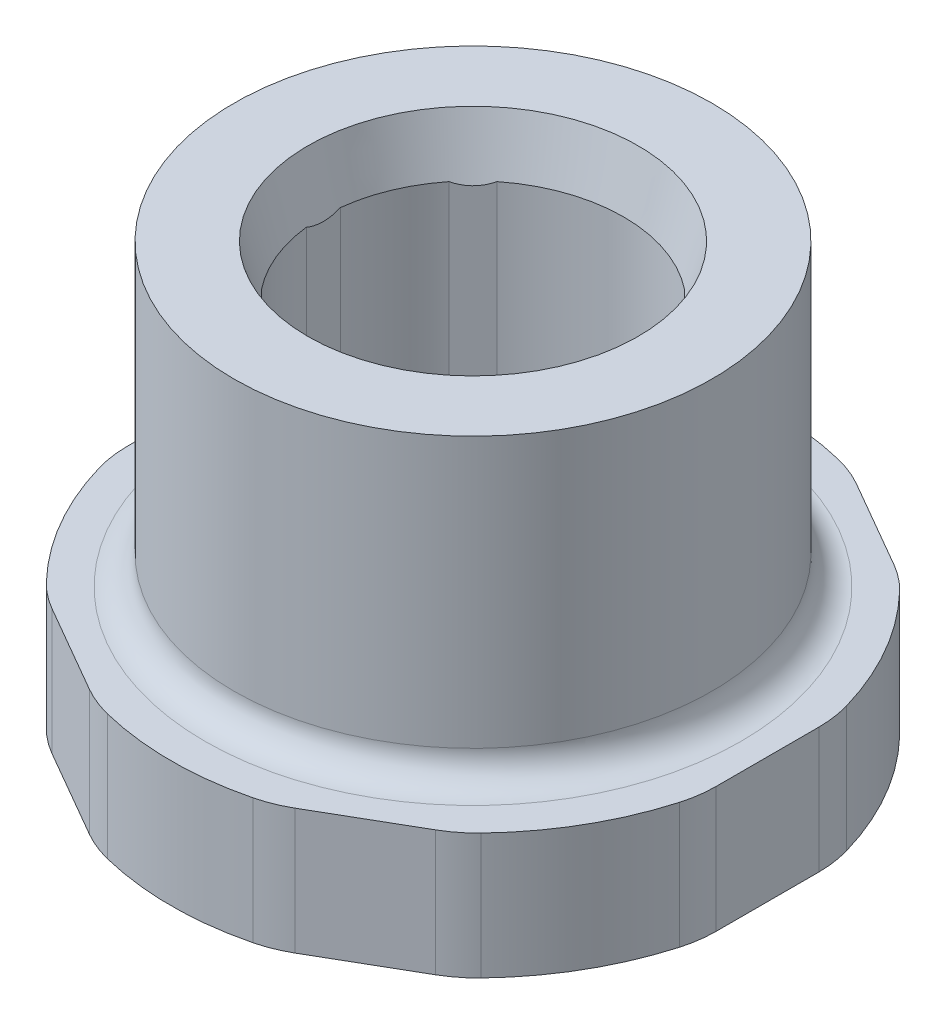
ISO-10303-21;
HEADER;
FILE_DESCRIPTION(('STEP AP214'),'2;1');
FILE_NAME('part.step','',(''),(''),'','','');
FILE_SCHEMA(('AUTOMOTIVE_DESIGN { 1 0 10303 214 1 1 1 1 }'));
ENDSEC;
DATA;
#1=APPLICATION_CONTEXT('core data for automotive mechanical design processes');
#2=APPLICATION_PROTOCOL_DEFINITION('international standard','automotive_design',2000,#1);
#3=PRODUCT_CONTEXT('',#1,'mechanical');
#4=PRODUCT('Part','Part','',(#3));
#5=PRODUCT_RELATED_PRODUCT_CATEGORY('part','',(#4));
#6=PRODUCT_DEFINITION_FORMATION('','',#4);
#7=PRODUCT_DEFINITION_CONTEXT('part definition',#1,'design');
#8=PRODUCT_DEFINITION('design','',#6,#7);
#9=PRODUCT_DEFINITION_SHAPE('','',#8);
#10=(LENGTH_UNIT() NAMED_UNIT(*) SI_UNIT(.MILLI.,.METRE.));
#11=(NAMED_UNIT(*) PLANE_ANGLE_UNIT() SI_UNIT($,.RADIAN.));
#12=(NAMED_UNIT(*) SI_UNIT($,.STERADIAN.) SOLID_ANGLE_UNIT());
#13=UNCERTAINTY_MEASURE_WITH_UNIT(LENGTH_MEASURE(1.E-05),#10,'distance_accuracy_value','');
#14=(GEOMETRIC_REPRESENTATION_CONTEXT(3) GLOBAL_UNCERTAINTY_ASSIGNED_CONTEXT((#13)) GLOBAL_UNIT_ASSIGNED_CONTEXT((#10,
#11,#12)) REPRESENTATION_CONTEXT('',''));
#15=CARTESIAN_POINT('',(0.,0.,0.));
#16=DIRECTION('',(0.,0.,1.));
#17=DIRECTION('',(1.,0.,0.));
#18=AXIS2_PLACEMENT_3D('',#15,#16,#17);
#19=CARTESIAN_POINT('',(0.,3.302,0.));
#20=DIRECTION('',(0.,1.,0.));
#21=DIRECTION('',(0.,0.,1.));
#22=AXIS2_PLACEMENT_3D('',#19,#20,#21);
#23=CYLINDRICAL_SURFACE('',#22,6.2865);
#24=CARTESIAN_POINT('',(0.,11.176,0.));
#25=DIRECTION('',(0.,1.,0.));
#26=DIRECTION('',(0.,0.,1.));
#27=AXIS2_PLACEMENT_3D('',#24,#25,#26);
#28=CIRCLE('',#27,6.2865);
#29=CARTESIAN_POINT('',(0.,11.176,6.2865));
#30=VERTEX_POINT('',#29);
#31=EDGE_CURVE('E324',#30,#30,#28,.T.);
#32=ORIENTED_EDGE('',*,*,#31,.F.);
#33=EDGE_LOOP('',(#32));
#34=FACE_BOUND('',#33,.T.);
#35=CARTESIAN_POINT('',(0.,4.064,0.));
#36=DIRECTION('',(0.,1.,0.));
#37=DIRECTION('',(0.,0.,1.));
#38=AXIS2_PLACEMENT_3D('',#35,#36,#37);
#39=CIRCLE('',#38,6.2865);
#40=CARTESIAN_POINT('',(0.,4.064,6.2865));
#41=VERTEX_POINT('',#40);
#42=EDGE_CURVE('E295',#41,#41,#39,.T.);
#43=ORIENTED_EDGE('',*,*,#42,.T.);
#44=EDGE_LOOP('',(#43));
#45=FACE_BOUND('',#44,.T.);
#46=ADVANCED_FACE('F16',(#34,#45),#23,.T.);
#47=CARTESIAN_POINT('',(0.,11.176,0.));
#48=DIRECTION('',(0.,1.,0.));
#49=DIRECTION('',(0.,0.,1.));
#50=AXIS2_PLACEMENT_3D('',#47,#48,#49);
#51=PLANE('',#50);
#52=CARTESIAN_POINT('',(0.,11.1760000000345,0.));
#53=DIRECTION('',(0.,1.,0.));
#54=DIRECTION('',(0.,0.,1.));
#55=AXIS2_PLACEMENT_3D('',#52,#53,#54);
#56=CIRCLE('',#55,4.3453545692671);
#57=CARTESIAN_POINT('',(0.,11.1760000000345,4.3453545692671));
#58=VERTEX_POINT('',#57);
#59=EDGE_CURVE('E450',#58,#58,#56,.F.);
#60=ORIENTED_EDGE('',*,*,#59,.T.);
#61=EDGE_LOOP('',(#60));
#62=FACE_BOUND('',#61,.T.);
#63=ORIENTED_EDGE('',*,*,#31,.T.);
#64=EDGE_LOOP('',(#63));
#65=FACE_BOUND('',#64,.T.);
#66=ADVANCED_FACE('F309',(#62,#65),#51,.T.);
#67=CARTESIAN_POINT('',(0.,4.064,0.));
#68=DIRECTION('',(0.,1.,0.));
#69=DIRECTION('',(0.,0.,1.));
#70=AXIS2_PLACEMENT_3D('',#67,#68,#69);
#71=TOROIDAL_SURFACE('',#70,7.0485,0.762);
#72=ORIENTED_EDGE('',*,*,#42,.F.);
#73=EDGE_LOOP('',(#72));
#74=FACE_BOUND('',#73,.T.);
#75=CARTESIAN_POINT('',(0.,3.302,0.));
#76=DIRECTION('',(0.,1.,0.));
#77=DIRECTION('',(0.,0.,-1.));
#78=AXIS2_PLACEMENT_3D('',#75,#76,#77);
#79=CIRCLE('',#78,7.0485);
#80=CARTESIAN_POINT('',(0.,3.302,7.0485));
#81=VERTEX_POINT('',#80);
#82=CARTESIAN_POINT('',(0.,3.302,-7.0485));
#83=VERTEX_POINT('',#82);
#84=EDGE_CURVE('E208',#81,#83,#79,.F.);
#85=ORIENTED_EDGE('',*,*,#84,.F.);
#86=CARTESIAN_POINT('',(0.,3.302,0.));
#87=DIRECTION('',(0.,1.,0.));
#88=DIRECTION('',(0.,0.,1.));
#89=AXIS2_PLACEMENT_3D('',#86,#87,#88);
#90=CIRCLE('',#89,7.0485);
#91=EDGE_CURVE('E200',#83,#81,#90,.F.);
#92=ORIENTED_EDGE('',*,*,#91,.F.);
#93=EDGE_LOOP('',(#85,#92));
#94=FACE_BOUND('',#93,.T.);
#95=ADVANCED_FACE('F304',(#74,#94),#71,.F.);
#96=CARTESIAN_POINT('',(-3.10061648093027,0.,-2.46714231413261));
#97=DIRECTION('',(-0.707106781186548,0.,-0.707106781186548));
#98=DIRECTION('',(-0.707106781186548,0.,0.707106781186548));
#99=AXIS2_PLACEMENT_3D('',#96,#97,#98);
#100=PLANE('',#99);
#101=DIRECTION('',(0.,1.,0.));
#102=VECTOR('',#101,1.);
#103=CARTESIAN_POINT('',(-3.10061648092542,0.,-2.4671423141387));
#104=LINE('',#103,#102);
#105=CARTESIAN_POINT('',(-3.10061648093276,9.74679409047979,-2.46714231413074));
#106=VERTEX_POINT('',#105);
#107=CARTESIAN_POINT('',(-3.10061648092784,0.,-2.46714231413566));
#108=VERTEX_POINT('',#107);
#109=EDGE_CURVE('E196',#106,#108,#104,.F.);
#110=ORIENTED_EDGE('',*,*,#109,.T.);
#111=DIRECTION('',(-0.707106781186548,0.,0.707106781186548));
#112=VECTOR('',#111,1.);
#113=CARTESIAN_POINT('',(-3.10061648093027,0.,-2.46714231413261));
#114=LINE('',#113,#112);
#115=CARTESIAN_POINT('',(-2.46714231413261,0.,-3.10061648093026));
#116=VERTEX_POINT('',#115);
#117=EDGE_CURVE('E290',#116,#108,#114,.T.);
#118=ORIENTED_EDGE('',*,*,#117,.F.);
#119=DIRECTION('',(0.,1.,0.));
#120=VECTOR('',#119,1.);
#121=CARTESIAN_POINT('',(-2.46714231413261,0.,-3.10061648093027));
#122=LINE('',#121,#120);
#123=CARTESIAN_POINT('',(-2.46714231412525,9.74679409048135,-3.10061648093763));
#124=VERTEX_POINT('',#123);
#125=EDGE_CURVE('E192',#116,#124,#122,.T.);
#126=ORIENTED_EDGE('',*,*,#125,.T.);
#127=CARTESIAN_POINT('',(-2.46714231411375,9.74679409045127,-3.10061648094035));
#128=CARTESIAN_POINT('',(-2.48822193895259,9.73421755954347,-3.07953685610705));
#129=CARTESIAN_POINT('',(-2.50961496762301,9.7226948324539,-3.05814382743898));
#130=CARTESIAN_POINT('',(-2.55298880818,9.70200605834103,-3.01476998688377));
#131=CARTESIAN_POINT('',(-2.57497026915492,9.69284274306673,-2.99278852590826));
#132=CARTESIAN_POINT('',(-2.64149273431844,9.66936732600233,-2.92626606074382));
#133=CARTESIAN_POINT('',(-2.68677583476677,9.65896851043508,-2.88098296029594));
#134=CARTESIAN_POINT('',(-2.77821338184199,9.65003691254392,-2.78954541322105));
#135=CARTESIAN_POINT('',(-2.82437155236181,9.65158058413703,-2.74338724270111));
#136=CARTESIAN_POINT('',(-2.91567508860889,9.66648499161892,-2.65208370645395));
#137=CARTESIAN_POINT('',(-2.96082129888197,9.67983546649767,-2.6069374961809));
#138=CARTESIAN_POINT('',(-3.02113646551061,9.70501160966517,-2.54662232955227));
#139=CARTESIAN_POINT('',(-3.03727955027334,9.71250307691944,-2.53047924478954));
#140=CARTESIAN_POINT('',(-3.06920889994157,9.72873699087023,-2.49854989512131));
#141=CARTESIAN_POINT('',(-3.08499586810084,9.73747666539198,-2.48276292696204));
#142=CARTESIAN_POINT('',(-3.10061648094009,9.74679409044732,-2.46714231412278));
#143=B_SPLINE_CURVE_WITH_KNOTS('',3,(#127,#128,#129,#130,#131,#132,#133,#134,#135,#136,#137,
#138,#139,#140,#141,#142),.UNSPECIFIED.,.F.,.F.,(4,2,2,2,2,2,2,4),(0.,0.0970342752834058,
0.194180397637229,0.387722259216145,0.582504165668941,0.777116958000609,0.849174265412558,
0.921073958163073),.UNSPECIFIED.);
#144=EDGE_CURVE('E271',#124,#106,#143,.T.);
#145=ORIENTED_EDGE('',*,*,#144,.T.);
#146=EDGE_LOOP('',(#110,#118,#126,#145));
#147=FACE_BOUND('',#146,.T.);
#148=ADVANCED_FACE('F308',(#147),#100,.F.);
#149=CARTESIAN_POINT('',(2.46714231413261,0.,-3.10061648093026));
#150=DIRECTION('',(0.707106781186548,0.,-0.707106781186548));
#151=DIRECTION('',(-0.707106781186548,0.,-0.707106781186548));
#152=AXIS2_PLACEMENT_3D('',#149,#150,#151);
#153=PLANE('',#152);
#154=DIRECTION('',(0.,1.,0.));
#155=VECTOR('',#154,1.);
#156=CARTESIAN_POINT('',(2.46714231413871,0.,-3.10061648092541));
#157=LINE('',#156,#155);
#158=CARTESIAN_POINT('',(2.46714231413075,9.74679409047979,-3.10061648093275));
#159=VERTEX_POINT('',#158);
#160=CARTESIAN_POINT('',(2.46714231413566,0.,-3.10061648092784));
#161=VERTEX_POINT('',#160);
#162=EDGE_CURVE('E189',#159,#161,#157,.F.);
#163=ORIENTED_EDGE('',*,*,#162,.T.);
#164=DIRECTION('',(-0.707106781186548,0.,-0.707106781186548));
#165=VECTOR('',#164,1.);
#166=CARTESIAN_POINT('',(2.46714231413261,0.,-3.10061648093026));
#167=LINE('',#166,#165);
#168=CARTESIAN_POINT('',(3.10061648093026,0.,-2.46714231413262));
#169=VERTEX_POINT('',#168);
#170=EDGE_CURVE('E286',#169,#161,#167,.T.);
#171=ORIENTED_EDGE('',*,*,#170,.F.);
#172=DIRECTION('',(0.,1.,0.));
#173=VECTOR('',#172,1.);
#174=CARTESIAN_POINT('',(3.10061648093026,0.,-2.46714231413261));
#175=LINE('',#174,#173);
#176=CARTESIAN_POINT('',(3.10061648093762,9.74679409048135,-2.46714231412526));
#177=VERTEX_POINT('',#176);
#178=EDGE_CURVE('E185',#169,#177,#175,.T.);
#179=ORIENTED_EDGE('',*,*,#178,.T.);
#180=CARTESIAN_POINT('',(3.10061648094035,9.74679409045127,-2.46714231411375));
#181=CARTESIAN_POINT('',(3.07953685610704,9.73421755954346,-2.4882219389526));
#182=CARTESIAN_POINT('',(3.05814382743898,9.72269483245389,-2.50961496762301));
#183=CARTESIAN_POINT('',(3.01476998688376,9.70200605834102,-2.55298880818));
#184=CARTESIAN_POINT('',(2.99278852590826,9.69284274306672,-2.57497026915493));
#185=CARTESIAN_POINT('',(2.92626606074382,9.66936732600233,-2.64149273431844));
#186=CARTESIAN_POINT('',(2.88098296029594,9.65896851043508,-2.68677583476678));
#187=CARTESIAN_POINT('',(2.78954541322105,9.65003691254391,-2.778213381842));
#188=CARTESIAN_POINT('',(2.74338724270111,9.65158058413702,-2.82437155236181));
#189=CARTESIAN_POINT('',(2.65208370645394,9.66648499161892,-2.91567508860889));
#190=CARTESIAN_POINT('',(2.60693749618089,9.67983546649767,-2.96082129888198));
#191=CARTESIAN_POINT('',(2.54662232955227,9.70501160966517,-3.02113646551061));
#192=CARTESIAN_POINT('',(2.53047924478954,9.71250307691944,-3.03727955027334));
#193=CARTESIAN_POINT('',(2.49854989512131,9.72873699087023,-3.06920889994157));
#194=CARTESIAN_POINT('',(2.48276292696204,9.73747666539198,-3.08499586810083));
#195=CARTESIAN_POINT('',(2.46714231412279,9.74679409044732,-3.10061648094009));
#196=B_SPLINE_CURVE_WITH_KNOTS('',3,(#180,#181,#182,#183,#184,#185,#186,#187,#188,#189,#190,
#191,#192,#193,#194,#195),.UNSPECIFIED.,.F.,.F.,(4,2,2,2,2,2,2,4),(0.,0.0970342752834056,
0.194180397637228,0.387722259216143,0.582504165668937,0.777116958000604,0.849174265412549,
0.921073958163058),.UNSPECIFIED.);
#197=EDGE_CURVE('E279',#177,#159,#196,.T.);
#198=ORIENTED_EDGE('',*,*,#197,.T.);
#199=EDGE_LOOP('',(#163,#171,#179,#198));
#200=FACE_BOUND('',#199,.T.);
#201=ADVANCED_FACE('F500',(#200),#153,.F.);
#202=CARTESIAN_POINT('',(3.937,0.,-0.447933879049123));
#203=DIRECTION('',(1.,0.,0.));
#204=DIRECTION('',(0.,0.,-1.));
#205=AXIS2_PLACEMENT_3D('',#202,#203,#204);
#206=PLANE('',#205);
#207=DIRECTION('',(0.,1.,0.));
#208=VECTOR('',#207,1.);
#209=CARTESIAN_POINT('',(3.937,0.,-0.447933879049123));
#210=LINE('',#209,#208);
#211=CARTESIAN_POINT('',(3.937,9.74679409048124,-0.447933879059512));
#212=VERTEX_POINT('',#211);
#213=CARTESIAN_POINT('',(3.937,0.,-0.447933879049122));
#214=VERTEX_POINT('',#213);
#215=EDGE_CURVE('E182',#212,#214,#210,.F.);
#216=ORIENTED_EDGE('',*,*,#215,.T.);
#217=DIRECTION('',(0.,0.,-1.));
#218=VECTOR('',#217,1.);
#219=CARTESIAN_POINT('',(3.937,0.,-0.447933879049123));
#220=LINE('',#219,#218);
#221=CARTESIAN_POINT('',(3.937,0.,0.447933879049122));
#222=VERTEX_POINT('',#221);
#223=EDGE_CURVE('E284',#222,#214,#220,.T.);
#224=ORIENTED_EDGE('',*,*,#223,.F.);
#225=DIRECTION('',(0.,1.,0.));
#226=VECTOR('',#225,1.);
#227=CARTESIAN_POINT('',(3.937,0.,0.447933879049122));
#228=LINE('',#227,#226);
#229=CARTESIAN_POINT('',(3.937,9.74679409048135,0.447933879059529));
#230=VERTEX_POINT('',#229);
#231=EDGE_CURVE('E172',#222,#230,#228,.T.);
#232=ORIENTED_EDGE('',*,*,#231,.T.);
#233=CARTESIAN_POINT('',(3.93699999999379,9.74679409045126,0.447933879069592));
#234=CARTESIAN_POINT('',(3.93699999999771,9.73421755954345,0.418122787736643));
#235=CARTESIAN_POINT('',(3.93699999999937,9.72269483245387,0.387868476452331));
#236=CARTESIAN_POINT('',(3.93700000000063,9.70200605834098,0.326528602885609));
#237=CARTESIAN_POINT('',(3.93700000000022,9.69284274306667,0.295442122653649));
#238=CARTESIAN_POINT('',(3.93699999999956,9.66936732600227,0.201365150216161));
#239=CARTESIAN_POINT('',(3.93699999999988,9.65896851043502,0.137325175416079));
#240=CARTESIAN_POINT('',(3.93700000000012,9.6500369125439,0.00801295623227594));
#241=CARTESIAN_POINT('',(3.93700000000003,9.65158058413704,-0.0572645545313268));
#242=CARTESIAN_POINT('',(3.93699999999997,9.66648499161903,-0.186387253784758));
#243=CARTESIAN_POINT('',(3.937,9.67983546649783,-0.250233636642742));
#244=CARTESIAN_POINT('',(3.937,9.70501160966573,-0.335532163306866));
#245=CARTESIAN_POINT('',(3.937,9.71250307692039,-0.358361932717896));
#246=CARTESIAN_POINT('',(3.937,9.72873699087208,-0.403516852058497));
#247=CARTESIAN_POINT('',(3.937,9.73747666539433,-0.425842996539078));
#248=CARTESIAN_POINT('',(3.937,9.74679409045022,-0.447933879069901));
#249=B_SPLINE_CURVE_WITH_KNOTS('',3,(#233,#234,#235,#236,#237,#238,#239,#240,#241,#242,#243,
#244,#245,#246,#247,#248),.UNSPECIFIED.,.F.,.F.,(4,2,2,2,2,2,2,4),(0.,0.0970342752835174,
0.194180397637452,0.387722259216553,0.582504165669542,0.777116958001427,0.849174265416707,
0.921073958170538),.UNSPECIFIED.);
#250=EDGE_CURVE('E165',#230,#212,#249,.T.);
#251=ORIENTED_EDGE('',*,*,#250,.T.);
#252=EDGE_LOOP('',(#216,#224,#232,#251));
#253=FACE_BOUND('',#252,.T.);
#254=ADVANCED_FACE('F496',(#253),#206,.F.);
#255=CARTESIAN_POINT('',(2.46714231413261,0.,3.10061648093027));
#256=DIRECTION('',(0.707106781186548,0.,0.707106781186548));
#257=DIRECTION('',(0.707106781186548,0.,-0.707106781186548));
#258=AXIS2_PLACEMENT_3D('',#255,#256,#257);
#259=PLANE('',#258);
#260=DIRECTION('',(0.,1.,0.));
#261=VECTOR('',#260,1.);
#262=CARTESIAN_POINT('',(3.10061648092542,0.,2.4671423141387));
#263=LINE('',#262,#261);
#264=CARTESIAN_POINT('',(3.10061648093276,9.74679409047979,2.46714231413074));
#265=VERTEX_POINT('',#264);
#266=CARTESIAN_POINT('',(3.10061648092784,0.,2.46714231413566));
#267=VERTEX_POINT('',#266);
#268=EDGE_CURVE('E177',#265,#267,#263,.F.);
#269=ORIENTED_EDGE('',*,*,#268,.T.);
#270=DIRECTION('',(0.707106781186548,0.,-0.707106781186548));
#271=VECTOR('',#270,1.);
#272=CARTESIAN_POINT('',(2.46714231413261,0.,3.10061648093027));
#273=LINE('',#272,#271);
#274=CARTESIAN_POINT('',(2.46714231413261,0.,3.10061648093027));
#275=VERTEX_POINT('',#274);
#276=EDGE_CURVE('E166',#275,#267,#273,.T.);
#277=ORIENTED_EDGE('',*,*,#276,.F.);
#278=DIRECTION('',(0.,1.,0.));
#279=VECTOR('',#278,1.);
#280=CARTESIAN_POINT('',(2.46714231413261,0.,3.10061648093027));
#281=LINE('',#280,#279);
#282=CARTESIAN_POINT('',(2.46714231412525,9.74679409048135,3.10061648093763));
#283=VERTEX_POINT('',#282);
#284=EDGE_CURVE('E151',#275,#283,#281,.T.);
#285=ORIENTED_EDGE('',*,*,#284,.T.);
#286=CARTESIAN_POINT('',(2.46714231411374,9.74679409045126,3.10061648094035));
#287=CARTESIAN_POINT('',(2.48822193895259,9.73421755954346,3.07953685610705));
#288=CARTESIAN_POINT('',(2.50961496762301,9.72269483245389,3.05814382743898));
#289=CARTESIAN_POINT('',(2.55298880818,9.70200605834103,3.01476998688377));
#290=CARTESIAN_POINT('',(2.57497026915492,9.69284274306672,2.99278852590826));
#291=CARTESIAN_POINT('',(2.64149273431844,9.66936732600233,2.92626606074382));
#292=CARTESIAN_POINT('',(2.68677583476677,9.65896851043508,2.88098296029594));
#293=CARTESIAN_POINT('',(2.77821338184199,9.65003691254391,2.78954541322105));
#294=CARTESIAN_POINT('',(2.82437155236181,9.65158058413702,2.74338724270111));
#295=CARTESIAN_POINT('',(2.91567508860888,9.66648499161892,2.65208370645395));
#296=CARTESIAN_POINT('',(2.96082129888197,9.67983546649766,2.6069374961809));
#297=CARTESIAN_POINT('',(3.02113646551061,9.70501160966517,2.54662232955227));
#298=CARTESIAN_POINT('',(3.03727955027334,9.71250307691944,2.53047924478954));
#299=CARTESIAN_POINT('',(3.06920889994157,9.72873699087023,2.4985498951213));
#300=CARTESIAN_POINT('',(3.08499586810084,9.73747666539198,2.48276292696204));
#301=CARTESIAN_POINT('',(3.10061648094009,9.74679409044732,2.46714231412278));
#302=B_SPLINE_CURVE_WITH_KNOTS('',3,(#286,#287,#288,#289,#290,#291,#292,#293,#294,#295,#296,
#297,#298,#299,#300,#301),.UNSPECIFIED.,.F.,.F.,(4,2,2,2,2,2,2,4),(0.,0.0970342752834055,
0.194180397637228,0.387722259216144,0.582504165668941,0.777116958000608,0.849174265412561,
0.921073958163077),.UNSPECIFIED.);
#303=EDGE_CURVE('E159',#283,#265,#302,.T.);
#304=ORIENTED_EDGE('',*,*,#303,.T.);
#305=EDGE_LOOP('',(#269,#277,#285,#304));
#306=FACE_BOUND('',#305,.T.);
#307=ADVANCED_FACE('F169',(#306),#259,.F.);
#308=CARTESIAN_POINT('',(-3.937,0.,-0.447933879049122));
#309=DIRECTION('',(-1.,0.,0.));
#310=DIRECTION('',(0.,0.,1.));
#311=AXIS2_PLACEMENT_3D('',#308,#309,#310);
#312=PLANE('',#311);
#313=DIRECTION('',(0.,1.,0.));
#314=VECTOR('',#313,1.);
#315=CARTESIAN_POINT('',(-3.93700000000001,0.,0.447933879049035));
#316=LINE('',#315,#314);
#317=CARTESIAN_POINT('',(-3.93700000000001,9.74679409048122,0.447933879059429));
#318=VERTEX_POINT('',#317);
#319=CARTESIAN_POINT('',(-3.93700000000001,0.,0.447933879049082));
#320=VERTEX_POINT('',#319);
#321=EDGE_CURVE('E730',#318,#320,#316,.F.);
#322=ORIENTED_EDGE('',*,*,#321,.T.);
#323=DIRECTION('',(0.,0.,1.));
#324=VECTOR('',#323,1.);
#325=CARTESIAN_POINT('',(-3.937,0.,-0.447933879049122));
#326=LINE('',#325,#324);
#327=CARTESIAN_POINT('',(-3.937,0.,-0.447933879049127));
#328=VERTEX_POINT('',#327);
#329=EDGE_CURVE('E272',#328,#320,#326,.T.);
#330=ORIENTED_EDGE('',*,*,#329,.F.);
#331=DIRECTION('',(0.,1.,0.));
#332=VECTOR('',#331,1.);
#333=CARTESIAN_POINT('',(-3.937,0.,-0.447933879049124));
#334=LINE('',#333,#332);
#335=CARTESIAN_POINT('',(-3.937,9.74679409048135,-0.447933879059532));
#336=VERTEX_POINT('',#335);
#337=EDGE_CURVE('E199',#328,#336,#334,.T.);
#338=ORIENTED_EDGE('',*,*,#337,.T.);
#339=CARTESIAN_POINT('',(-3.93699999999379,9.74679409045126,-0.447933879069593));
#340=CARTESIAN_POINT('',(-3.93699999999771,9.73421755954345,-0.418122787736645));
#341=CARTESIAN_POINT('',(-3.93699999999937,9.72269483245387,-0.387868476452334));
#342=CARTESIAN_POINT('',(-3.93700000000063,9.70200605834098,-0.326528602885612));
#343=CARTESIAN_POINT('',(-3.93700000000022,9.69284274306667,-0.295442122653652));
#344=CARTESIAN_POINT('',(-3.93699999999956,9.66936732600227,-0.201365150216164));
#345=CARTESIAN_POINT('',(-3.93699999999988,9.65896851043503,-0.137325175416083));
#346=CARTESIAN_POINT('',(-3.93700000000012,9.6500369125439,-0.00801295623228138));
#347=CARTESIAN_POINT('',(-3.93700000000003,9.65158058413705,0.0572645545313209));
#348=CARTESIAN_POINT('',(-3.93699999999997,9.66648499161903,0.186387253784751));
#349=CARTESIAN_POINT('',(-3.937,9.67983546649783,0.250233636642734));
#350=CARTESIAN_POINT('',(-3.937,9.70501160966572,0.335532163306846));
#351=CARTESIAN_POINT('',(-3.937,9.71250307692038,0.358361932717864));
#352=CARTESIAN_POINT('',(-3.937,9.72873699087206,0.403516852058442));
#353=CARTESIAN_POINT('',(-3.937,9.7374766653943,0.425842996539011));
#354=CARTESIAN_POINT('',(-3.937,9.74679409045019,0.447933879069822));
#355=B_SPLINE_CURVE_WITH_KNOTS('',3,(#339,#340,#341,#342,#343,#344,#345,#346,#347,#348,#349,
#350,#351,#352,#353,#354),.UNSPECIFIED.,.F.,.F.,(4,2,2,2,2,2,2,4),(0.,0.0970342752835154,
0.194180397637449,0.387722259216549,0.582504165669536,0.777116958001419,0.849174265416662,
0.921073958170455),.UNSPECIFIED.);
#356=EDGE_CURVE('E460',#336,#318,#355,.T.);
#357=ORIENTED_EDGE('',*,*,#356,.T.);
#358=EDGE_LOOP('',(#322,#330,#338,#357));
#359=FACE_BOUND('',#358,.T.);
#360=ADVANCED_FACE('F495',(#359),#312,.F.);
#361=CARTESIAN_POINT('',(-3.10061648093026,0.,2.46714231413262));
#362=DIRECTION('',(-0.707106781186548,0.,0.707106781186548));
#363=DIRECTION('',(0.707106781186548,0.,0.707106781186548));
#364=AXIS2_PLACEMENT_3D('',#361,#362,#363);
#365=PLANE('',#364);
#366=DIRECTION('',(0.,1.,0.));
#367=VECTOR('',#366,1.);
#368=CARTESIAN_POINT('',(-2.46714231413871,0.,3.10061648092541));
#369=LINE('',#368,#367);
#370=CARTESIAN_POINT('',(-2.46714231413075,9.74679409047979,3.10061648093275));
#371=VERTEX_POINT('',#370);
#372=CARTESIAN_POINT('',(-2.46714231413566,0.,3.10061648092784));
#373=VERTEX_POINT('',#372);
#374=EDGE_CURVE('E154',#371,#373,#369,.F.);
#375=ORIENTED_EDGE('',*,*,#374,.T.);
#376=DIRECTION('',(0.707106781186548,0.,0.707106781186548));
#377=VECTOR('',#376,1.);
#378=CARTESIAN_POINT('',(-3.10061648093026,0.,2.46714231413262));
#379=LINE('',#378,#377);
#380=CARTESIAN_POINT('',(-3.10061648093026,0.,2.46714231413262));
#381=VERTEX_POINT('',#380);
#382=EDGE_CURVE('E268',#381,#373,#379,.T.);
#383=ORIENTED_EDGE('',*,*,#382,.F.);
#384=DIRECTION('',(0.,1.,0.));
#385=VECTOR('',#384,1.);
#386=CARTESIAN_POINT('',(-3.10061648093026,0.,2.46714231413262));
#387=LINE('',#386,#385);
#388=CARTESIAN_POINT('',(-3.10061648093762,9.74679409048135,2.46714231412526));
#389=VERTEX_POINT('',#388);
#390=EDGE_CURVE('E277',#381,#389,#387,.T.);
#391=ORIENTED_EDGE('',*,*,#390,.T.);
#392=CARTESIAN_POINT('',(-3.10061648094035,9.74679409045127,2.46714231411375));
#393=CARTESIAN_POINT('',(-3.07953685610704,9.73421755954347,2.4882219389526));
#394=CARTESIAN_POINT('',(-3.05814382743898,9.7226948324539,2.50961496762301));
#395=CARTESIAN_POINT('',(-3.01476998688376,9.70200605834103,2.55298880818));
#396=CARTESIAN_POINT('',(-2.99278852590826,9.69284274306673,2.57497026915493));
#397=CARTESIAN_POINT('',(-2.92626606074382,9.66936732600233,2.64149273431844));
#398=CARTESIAN_POINT('',(-2.88098296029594,9.65896851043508,2.68677583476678));
#399=CARTESIAN_POINT('',(-2.78954541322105,9.65003691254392,2.778213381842));
#400=CARTESIAN_POINT('',(-2.74338724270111,9.65158058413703,2.82437155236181));
#401=CARTESIAN_POINT('',(-2.65208370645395,9.66648499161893,2.91567508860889));
#402=CARTESIAN_POINT('',(-2.60693749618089,9.67983546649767,2.96082129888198));
#403=CARTESIAN_POINT('',(-2.54662232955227,9.70501160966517,3.02113646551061));
#404=CARTESIAN_POINT('',(-2.53047924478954,9.71250307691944,3.03727955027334));
#405=CARTESIAN_POINT('',(-2.49854989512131,9.72873699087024,3.06920889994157));
#406=CARTESIAN_POINT('',(-2.48276292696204,9.73747666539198,3.08499586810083));
#407=CARTESIAN_POINT('',(-2.46714231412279,9.74679409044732,3.10061648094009));
#408=B_SPLINE_CURVE_WITH_KNOTS('',3,(#392,#393,#394,#395,#396,#397,#398,#399,#400,#401,#402,
#403,#404,#405,#406,#407),.UNSPECIFIED.,.F.,.F.,(4,2,2,2,2,2,2,4),(0.,0.0970342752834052,
0.194180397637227,0.387722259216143,0.582504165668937,0.777116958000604,0.849174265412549,
0.921073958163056),.UNSPECIFIED.);
#409=EDGE_CURVE('E453',#389,#371,#408,.T.);
#410=ORIENTED_EDGE('',*,*,#409,.T.);
#411=EDGE_LOOP('',(#375,#383,#391,#410));
#412=FACE_BOUND('',#411,.T.);
#413=ADVANCED_FACE('F466',(#412),#365,.F.);
#414=CARTESIAN_POINT('',(0.,11.1760000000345,0.));
#415=DIRECTION('',(0.,1.,0.));
#416=DIRECTION('',(0.,0.,1.));
#417=AXIS2_PLACEMENT_3D('',#414,#415,#416);
#418=CONICAL_SURFACE('',#417,4.3453545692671,0.26179938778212);
#419=ORIENTED_EDGE('',*,*,#59,.F.);
#420=EDGE_LOOP('',(#419));
#421=FACE_BOUND('',#420,.T.);
#422=CARTESIAN_POINT('',(0.,9.74679409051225,0.));
#423=DIRECTION('',(0.,1.,0.));
#424=DIRECTION('',(0.,0.,1.));
#425=AXIS2_PLACEMENT_3D('',#422,#423,#424);
#426=CIRCLE('',#425,3.9624);
#427=EDGE_CURVE('E186',#124,#159,#426,.F.);
#428=ORIENTED_EDGE('',*,*,#427,.T.);
#429=ORIENTED_EDGE('',*,*,#197,.F.);
#430=CARTESIAN_POINT('',(0.,9.74679409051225,0.));
#431=DIRECTION('',(0.,1.,0.));
#432=DIRECTION('',(0.,0.,1.));
#433=AXIS2_PLACEMENT_3D('',#430,#431,#432);
#434=CIRCLE('',#433,3.9624);
#435=EDGE_CURVE('E179',#177,#212,#434,.F.);
#436=ORIENTED_EDGE('',*,*,#435,.T.);
#437=ORIENTED_EDGE('',*,*,#250,.F.);
#438=CARTESIAN_POINT('',(0.,9.74679409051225,0.));
#439=DIRECTION('',(0.,1.,0.));
#440=DIRECTION('',(0.,0.,1.));
#441=AXIS2_PLACEMENT_3D('',#438,#439,#440);
#442=CIRCLE('',#441,3.9624);
#443=EDGE_CURVE('E162',#230,#265,#442,.F.);
#444=ORIENTED_EDGE('',*,*,#443,.T.);
#445=ORIENTED_EDGE('',*,*,#303,.F.);
#446=CARTESIAN_POINT('',(0.,9.74679409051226,0.));
#447=DIRECTION('',(0.,1.,0.));
#448=DIRECTION('',(0.,0.,1.));
#449=AXIS2_PLACEMENT_3D('',#446,#447,#448);
#450=CIRCLE('',#449,3.9624);
#451=EDGE_CURVE('E145',#283,#371,#450,.F.);
#452=ORIENTED_EDGE('',*,*,#451,.T.);
#453=ORIENTED_EDGE('',*,*,#409,.F.);
#454=CARTESIAN_POINT('',(0.,9.74679409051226,0.));
#455=DIRECTION('',(0.,1.,0.));
#456=DIRECTION('',(0.,0.,1.));
#457=AXIS2_PLACEMENT_3D('',#454,#455,#456);
#458=CIRCLE('',#457,3.9624);
#459=EDGE_CURVE('E273',#389,#318,#458,.F.);
#460=ORIENTED_EDGE('',*,*,#459,.T.);
#461=ORIENTED_EDGE('',*,*,#356,.F.);
#462=CARTESIAN_POINT('',(0.,9.74679409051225,0.));
#463=DIRECTION('',(0.,1.,0.));
#464=DIRECTION('',(0.,0.,1.));
#465=AXIS2_PLACEMENT_3D('',#462,#463,#464);
#466=CIRCLE('',#465,3.9624);
#467=EDGE_CURVE('E193',#336,#106,#466,.F.);
#468=ORIENTED_EDGE('',*,*,#467,.T.);
#469=ORIENTED_EDGE('',*,*,#144,.F.);
#470=EDGE_LOOP('',(#428,#429,#436,#437,#444,#445,#452,#453,#460,#461,#468,#469));
#471=FACE_BOUND('',#470,.T.);
#472=ADVANCED_FACE('F160',(#421,#471),#418,.F.);
#473=CARTESIAN_POINT('',(4.699,11.176,1.35152108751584));
#474=DIRECTION('',(0.,-1.,0.));
#475=DIRECTION('',(0.,0.,-1.));
#476=AXIS2_PLACEMENT_3D('',#473,#474,#475);
#477=CYLINDRICAL_SURFACE('',#476,3.048);
#478=CARTESIAN_POINT('',(4.699,3.302,1.35152108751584));
#479=DIRECTION('',(0.,-1.,0.));
#480=DIRECTION('',(0.,0.,-1.));
#481=AXIS2_PLACEMENT_3D('',#478,#479,#480);
#482=CIRCLE('',#481,3.048);
#483=CARTESIAN_POINT('',(7.62824675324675,3.302,2.19402773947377));
#484=VERTEX_POINT('',#483);
#485=CARTESIAN_POINT('',(7.747,3.302,1.35152108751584));
#486=VERTEX_POINT('',#485);
#487=EDGE_CURVE('E418',#484,#486,#482,.F.);
#488=ORIENTED_EDGE('',*,*,#487,.F.);
#489=DIRECTION('',(0.,-1.,0.));
#490=VECTOR('',#489,1.);
#491=CARTESIAN_POINT('',(7.62824675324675,11.176,2.19402773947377));
#492=LINE('',#491,#490);
#493=CARTESIAN_POINT('',(7.62824675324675,0.,2.19402773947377));
#494=VERTEX_POINT('',#493);
#495=EDGE_CURVE('E276',#494,#484,#492,.F.);
#496=ORIENTED_EDGE('',*,*,#495,.F.);
#497=CARTESIAN_POINT('',(4.699,0.,1.35152108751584));
#498=DIRECTION('',(0.,-1.,0.));
#499=DIRECTION('',(0.,0.,-1.));
#500=AXIS2_PLACEMENT_3D('',#497,#498,#499);
#501=CIRCLE('',#500,3.048);
#502=CARTESIAN_POINT('',(7.747,0.,1.35152108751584));
#503=VERTEX_POINT('',#502);
#504=EDGE_CURVE('E448',#494,#503,#501,.F.);
#505=ORIENTED_EDGE('',*,*,#504,.T.);
#506=DIRECTION('',(0.,1.,0.));
#507=VECTOR('',#506,1.);
#508=CARTESIAN_POINT('',(7.747,0.,1.35152108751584));
#509=LINE('',#508,#507);
#510=EDGE_CURVE('E267',#503,#486,#509,.T.);
#511=ORIENTED_EDGE('',*,*,#510,.T.);
#512=EDGE_LOOP('',(#488,#496,#505,#511));
#513=FACE_BOUND('',#512,.T.);
#514=ADVANCED_FACE('F471',(#513),#477,.T.);
#515=CARTESIAN_POINT('',(4.699,11.176,-1.35152108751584));
#516=DIRECTION('',(0.,-1.,0.));
#517=DIRECTION('',(0.,0.,-1.));
#518=AXIS2_PLACEMENT_3D('',#515,#516,#517);
#519=CYLINDRICAL_SURFACE('',#518,3.048);
#520=CARTESIAN_POINT('',(4.699,0.,-1.35152108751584));
#521=DIRECTION('',(0.,-1.,0.));
#522=DIRECTION('',(0.,0.,-1.));
#523=AXIS2_PLACEMENT_3D('',#520,#521,#522);
#524=CIRCLE('',#523,3.048);
#525=CARTESIAN_POINT('',(7.747,0.,-1.35152108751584));
#526=VERTEX_POINT('',#525);
#527=CARTESIAN_POINT('',(7.62824675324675,0.,-2.19402773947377));
#528=VERTEX_POINT('',#527);
#529=EDGE_CURVE('E446',#526,#528,#524,.F.);
#530=ORIENTED_EDGE('',*,*,#529,.T.);
#531=DIRECTION('',(0.,-1.,0.));
#532=VECTOR('',#531,1.);
#533=CARTESIAN_POINT('',(7.62824675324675,11.176,-2.19402773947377));
#534=LINE('',#533,#532);
#535=CARTESIAN_POINT('',(7.62824675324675,3.302,-2.19402773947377));
#536=VERTEX_POINT('',#535);
#537=EDGE_CURVE('E385',#536,#528,#534,.T.);
#538=ORIENTED_EDGE('',*,*,#537,.F.);
#539=CARTESIAN_POINT('',(4.699,3.302,-1.35152108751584));
#540=DIRECTION('',(0.,-1.,0.));
#541=DIRECTION('',(0.,0.,-1.));
#542=AXIS2_PLACEMENT_3D('',#539,#540,#541);
#543=CIRCLE('',#542,3.048);
#544=CARTESIAN_POINT('',(7.747,3.302,-1.35152108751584));
#545=VERTEX_POINT('',#544);
#546=EDGE_CURVE('E415',#545,#536,#543,.F.);
#547=ORIENTED_EDGE('',*,*,#546,.F.);
#548=DIRECTION('',(0.,1.,0.));
#549=VECTOR('',#548,1.);
#550=CARTESIAN_POINT('',(7.747,0.,-1.35152108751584));
#551=LINE('',#550,#549);
#552=EDGE_CURVE('E266',#545,#526,#551,.F.);
#553=ORIENTED_EDGE('',*,*,#552,.T.);
#554=EDGE_LOOP('',(#530,#538,#547,#553));
#555=FACE_BOUND('',#554,.T.);
#556=ADVANCED_FACE('F766',(#555),#519,.T.);
#557=CARTESIAN_POINT('',(3.5199515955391,11.176,-3.39369282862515));
#558=DIRECTION('',(0.,-1.,0.));
#559=DIRECTION('',(0.,0.,-1.));
#560=AXIS2_PLACEMENT_3D('',#557,#558,#559);
#561=CYLINDRICAL_SURFACE('',#560,3.048);
#562=CARTESIAN_POINT('',(3.5199515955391,3.302,-3.39369282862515));
#563=DIRECTION('',(0.,-1.,0.));
#564=DIRECTION('',(0.,0.,-1.));
#565=AXIS2_PLACEMENT_3D('',#562,#563,#564);
#566=CIRCLE('',#565,3.048);
#567=CARTESIAN_POINT('',(5.71420713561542,3.302,-5.50924160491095));
#568=VERTEX_POINT('',#567);
#569=CARTESIAN_POINT('',(5.04395159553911,3.302,-6.03333825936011));
#570=VERTEX_POINT('',#569);
#571=EDGE_CURVE('E412',#568,#570,#566,.F.);
#572=ORIENTED_EDGE('',*,*,#571,.F.);
#573=DIRECTION('',(0.,-1.,0.));
#574=VECTOR('',#573,1.);
#575=CARTESIAN_POINT('',(5.71420713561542,11.176,-5.50924160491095));
#576=LINE('',#575,#574);
#577=CARTESIAN_POINT('',(5.71420713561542,0.,-5.50924160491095));
#578=VERTEX_POINT('',#577);
#579=EDGE_CURVE('E386',#578,#568,#576,.F.);
#580=ORIENTED_EDGE('',*,*,#579,.F.);
#581=CARTESIAN_POINT('',(3.5199515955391,0.,-3.39369282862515));
#582=DIRECTION('',(0.,-1.,0.));
#583=DIRECTION('',(0.,0.,-1.));
#584=AXIS2_PLACEMENT_3D('',#581,#582,#583);
#585=CIRCLE('',#584,3.048);
#586=CARTESIAN_POINT('',(5.04395159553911,0.,-6.03333825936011));
#587=VERTEX_POINT('',#586);
#588=EDGE_CURVE('E444',#578,#587,#585,.F.);
#589=ORIENTED_EDGE('',*,*,#588,.T.);
#590=DIRECTION('',(0.,1.,0.));
#591=VECTOR('',#590,1.);
#592=CARTESIAN_POINT('',(5.04395159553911,0.,-6.03333825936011));
#593=LINE('',#592,#591);
#594=EDGE_CURVE('E262',#587,#570,#593,.T.);
#595=ORIENTED_EDGE('',*,*,#594,.T.);
#596=EDGE_LOOP('',(#572,#580,#589,#595));
#597=FACE_BOUND('',#596,.T.);
#598=ADVANCED_FACE('F773',(#597),#561,.T.);
#599=CARTESIAN_POINT('',(1.17904840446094,11.176,-4.74521391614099));
#600=DIRECTION('',(0.,-1.,0.));
#601=DIRECTION('',(0.,0.,-1.));
#602=AXIS2_PLACEMENT_3D('',#599,#600,#601);
#603=CYLINDRICAL_SURFACE('',#602,3.048);
#604=CARTESIAN_POINT('',(1.17904840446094,0.,-4.74521391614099));
#605=DIRECTION('',(0.,-1.,0.));
#606=DIRECTION('',(0.,0.,-1.));
#607=AXIS2_PLACEMENT_3D('',#604,#605,#606);
#608=CIRCLE('',#607,3.048);
#609=CARTESIAN_POINT('',(2.70304840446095,0.,-7.38485934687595));
#610=VERTEX_POINT('',#609);
#611=CARTESIAN_POINT('',(1.9140396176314,0.,-7.70326934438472));
#612=VERTEX_POINT('',#611);
#613=EDGE_CURVE('E442',#610,#612,#608,.F.);
#614=ORIENTED_EDGE('',*,*,#613,.T.);
#615=DIRECTION('',(0.,-1.,0.));
#616=VECTOR('',#615,1.);
#617=CARTESIAN_POINT('',(1.9140396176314,11.176,-7.70326934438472));
#618=LINE('',#617,#616);
#619=CARTESIAN_POINT('',(1.9140396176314,3.302,-7.70326934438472));
#620=VERTEX_POINT('',#619);
#621=EDGE_CURVE('E381',#620,#612,#618,.T.);
#622=ORIENTED_EDGE('',*,*,#621,.F.);
#623=CARTESIAN_POINT('',(1.17904840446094,3.302,-4.74521391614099));
#624=DIRECTION('',(0.,-1.,0.));
#625=DIRECTION('',(0.,0.,-1.));
#626=AXIS2_PLACEMENT_3D('',#623,#624,#625);
#627=CIRCLE('',#626,3.048);
#628=CARTESIAN_POINT('',(2.70304840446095,3.302,-7.38485934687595));
#629=VERTEX_POINT('',#628);
#630=EDGE_CURVE('E409',#629,#620,#627,.F.);
#631=ORIENTED_EDGE('',*,*,#630,.F.);
#632=DIRECTION('',(0.,1.,0.));
#633=VECTOR('',#632,1.);
#634=CARTESIAN_POINT('',(2.70304840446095,0.,-7.38485934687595));
#635=LINE('',#634,#633);
#636=EDGE_CURVE('E261',#629,#610,#635,.F.);
#637=ORIENTED_EDGE('',*,*,#636,.T.);
#638=EDGE_LOOP('',(#614,#622,#631,#637));
#639=FACE_BOUND('',#638,.T.);
#640=ADVANCED_FACE('F780',(#639),#603,.T.);
#641=CARTESIAN_POINT('',(-1.1790484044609,11.176,-4.745213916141));
#642=DIRECTION('',(0.,-1.,0.));
#643=DIRECTION('',(0.,0.,-1.));
#644=AXIS2_PLACEMENT_3D('',#641,#642,#643);
#645=CYLINDRICAL_SURFACE('',#644,3.048);
#646=CARTESIAN_POINT('',(-1.1790484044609,3.302,-4.745213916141));
#647=DIRECTION('',(0.,-1.,0.));
#648=DIRECTION('',(0.,0.,-1.));
#649=AXIS2_PLACEMENT_3D('',#646,#647,#648);
#650=CIRCLE('',#649,3.048);
#651=CARTESIAN_POINT('',(-1.91403961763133,3.302,-7.70326934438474));
#652=VERTEX_POINT('',#651);
#653=CARTESIAN_POINT('',(-2.70304840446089,3.302,-7.38485934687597));
#654=VERTEX_POINT('',#653);
#655=EDGE_CURVE('E406',#652,#654,#650,.F.);
#656=ORIENTED_EDGE('',*,*,#655,.F.);
#657=DIRECTION('',(0.,-1.,0.));
#658=VECTOR('',#657,1.);
#659=CARTESIAN_POINT('',(-1.91403961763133,11.176,-7.70326934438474));
#660=LINE('',#659,#658);
#661=CARTESIAN_POINT('',(-1.91403961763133,0.,-7.70326934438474));
#662=VERTEX_POINT('',#661);
#663=EDGE_CURVE('E380',#662,#652,#660,.F.);
#664=ORIENTED_EDGE('',*,*,#663,.F.);
#665=CARTESIAN_POINT('',(-1.1790484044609,0.,-4.745213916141));
#666=DIRECTION('',(0.,-1.,0.));
#667=DIRECTION('',(0.,0.,-1.));
#668=AXIS2_PLACEMENT_3D('',#665,#666,#667);
#669=CIRCLE('',#668,3.048);
#670=CARTESIAN_POINT('',(-2.70304840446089,0.,-7.38485934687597));
#671=VERTEX_POINT('',#670);
#672=EDGE_CURVE('E440',#662,#671,#669,.F.);
#673=ORIENTED_EDGE('',*,*,#672,.T.);
#674=DIRECTION('',(0.,1.,0.));
#675=VECTOR('',#674,1.);
#676=CARTESIAN_POINT('',(-2.70304840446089,0.,-7.38485934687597));
#677=LINE('',#676,#675);
#678=EDGE_CURVE('E257',#671,#654,#677,.T.);
#679=ORIENTED_EDGE('',*,*,#678,.T.);
#680=EDGE_LOOP('',(#656,#664,#673,#679));
#681=FACE_BOUND('',#680,.T.);
#682=ADVANCED_FACE('F788',(#681),#645,.T.);
#683=CARTESIAN_POINT('',(-3.51995159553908,11.176,-3.39369282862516));
#684=DIRECTION('',(0.,-1.,0.));
#685=DIRECTION('',(0.,0.,-1.));
#686=AXIS2_PLACEMENT_3D('',#683,#684,#685);
#687=CYLINDRICAL_SURFACE('',#686,3.048);
#688=CARTESIAN_POINT('',(-3.51995159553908,0.,-3.39369282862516));
#689=DIRECTION('',(0.,-1.,0.));
#690=DIRECTION('',(0.,0.,-1.));
#691=AXIS2_PLACEMENT_3D('',#688,#689,#690);
#692=CIRCLE('',#691,3.048);
#693=CARTESIAN_POINT('',(-5.04395159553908,0.,-6.03333825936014));
#694=VERTEX_POINT('',#693);
#695=CARTESIAN_POINT('',(-5.71420713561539,0.,-5.50924160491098));
#696=VERTEX_POINT('',#695);
#697=EDGE_CURVE('E438',#694,#696,#692,.F.);
#698=ORIENTED_EDGE('',*,*,#697,.T.);
#699=DIRECTION('',(0.,-1.,0.));
#700=VECTOR('',#699,1.);
#701=CARTESIAN_POINT('',(-5.71420713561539,11.176,-5.50924160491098));
#702=LINE('',#701,#700);
#703=CARTESIAN_POINT('',(-5.71420713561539,3.302,-5.50924160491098));
#704=VERTEX_POINT('',#703);
#705=EDGE_CURVE('E375',#704,#696,#702,.T.);
#706=ORIENTED_EDGE('',*,*,#705,.F.);
#707=CARTESIAN_POINT('',(-3.51995159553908,3.302,-3.39369282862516));
#708=DIRECTION('',(0.,-1.,0.));
#709=DIRECTION('',(0.,0.,-1.));
#710=AXIS2_PLACEMENT_3D('',#707,#708,#709);
#711=CIRCLE('',#710,3.048);
#712=CARTESIAN_POINT('',(-5.04395159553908,3.302,-6.03333825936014));
#713=VERTEX_POINT('',#712);
#714=EDGE_CURVE('E403',#713,#704,#711,.F.);
#715=ORIENTED_EDGE('',*,*,#714,.F.);
#716=DIRECTION('',(0.,1.,0.));
#717=VECTOR('',#716,1.);
#718=CARTESIAN_POINT('',(-5.04395159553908,0.,-6.03333825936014));
#719=LINE('',#718,#717);
#720=EDGE_CURVE('E256',#713,#694,#719,.F.);
#721=ORIENTED_EDGE('',*,*,#720,.T.);
#722=EDGE_LOOP('',(#698,#706,#715,#721));
#723=FACE_BOUND('',#722,.T.);
#724=ADVANCED_FACE('F796',(#723),#687,.T.);
#725=CARTESIAN_POINT('',(-4.699,11.176,-1.35152108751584));
#726=DIRECTION('',(0.,-1.,0.));
#727=DIRECTION('',(0.,0.,-1.));
#728=AXIS2_PLACEMENT_3D('',#725,#726,#727);
#729=CYLINDRICAL_SURFACE('',#728,3.048);
#730=CARTESIAN_POINT('',(-4.699,3.302,-1.35152108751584));
#731=DIRECTION('',(0.,-1.,0.));
#732=DIRECTION('',(0.,0.,-1.));
#733=AXIS2_PLACEMENT_3D('',#730,#731,#732);
#734=CIRCLE('',#733,3.048);
#735=CARTESIAN_POINT('',(-7.62824675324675,3.302,-2.19402773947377));
#736=VERTEX_POINT('',#735);
#737=CARTESIAN_POINT('',(-7.747,3.302,-1.35152108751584));
#738=VERTEX_POINT('',#737);
#739=EDGE_CURVE('E400',#736,#738,#734,.F.);
#740=ORIENTED_EDGE('',*,*,#739,.F.);
#741=DIRECTION('',(0.,-1.,0.));
#742=VECTOR('',#741,1.);
#743=CARTESIAN_POINT('',(-7.62824675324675,11.176,-2.19402773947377));
#744=LINE('',#743,#742);
#745=CARTESIAN_POINT('',(-7.62824675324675,0.,-2.19402773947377));
#746=VERTEX_POINT('',#745);
#747=EDGE_CURVE('E376',#746,#736,#744,.F.);
#748=ORIENTED_EDGE('',*,*,#747,.F.);
#749=CARTESIAN_POINT('',(-4.699,0.,-1.35152108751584));
#750=DIRECTION('',(0.,-1.,0.));
#751=DIRECTION('',(0.,0.,-1.));
#752=AXIS2_PLACEMENT_3D('',#749,#750,#751);
#753=CIRCLE('',#752,3.048);
#754=CARTESIAN_POINT('',(-7.747,0.,-1.35152108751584));
#755=VERTEX_POINT('',#754);
#756=EDGE_CURVE('E436',#746,#755,#753,.F.);
#757=ORIENTED_EDGE('',*,*,#756,.T.);
#758=DIRECTION('',(0.,1.,0.));
#759=VECTOR('',#758,1.);
#760=CARTESIAN_POINT('',(-7.747,0.,-1.35152108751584));
#761=LINE('',#760,#759);
#762=EDGE_CURVE('E252',#755,#738,#761,.T.);
#763=ORIENTED_EDGE('',*,*,#762,.T.);
#764=EDGE_LOOP('',(#740,#748,#757,#763));
#765=FACE_BOUND('',#764,.T.);
#766=ADVANCED_FACE('F804',(#765),#729,.T.);
#767=CARTESIAN_POINT('',(-4.699,11.176,1.35152108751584));
#768=DIRECTION('',(0.,-1.,0.));
#769=DIRECTION('',(0.,0.,-1.));
#770=AXIS2_PLACEMENT_3D('',#767,#768,#769);
#771=CYLINDRICAL_SURFACE('',#770,3.048);
#772=CARTESIAN_POINT('',(-4.699,0.,1.35152108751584));
#773=DIRECTION('',(0.,-1.,0.));
#774=DIRECTION('',(0.,0.,-1.));
#775=AXIS2_PLACEMENT_3D('',#772,#773,#774);
#776=CIRCLE('',#775,3.048);
#777=CARTESIAN_POINT('',(-7.747,0.,1.35152108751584));
#778=VERTEX_POINT('',#777);
#779=CARTESIAN_POINT('',(-7.62824675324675,0.,2.19402773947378));
#780=VERTEX_POINT('',#779);
#781=EDGE_CURVE('E434',#778,#780,#776,.F.);
#782=ORIENTED_EDGE('',*,*,#781,.T.);
#783=DIRECTION('',(0.,-1.,0.));
#784=VECTOR('',#783,1.);
#785=CARTESIAN_POINT('',(-7.62824675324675,11.176,2.19402773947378));
#786=LINE('',#785,#784);
#787=CARTESIAN_POINT('',(-7.62824675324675,3.302,2.19402773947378));
#788=VERTEX_POINT('',#787);
#789=EDGE_CURVE('E370',#788,#780,#786,.T.);
#790=ORIENTED_EDGE('',*,*,#789,.F.);
#791=CARTESIAN_POINT('',(-4.699,3.302,1.35152108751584));
#792=DIRECTION('',(0.,-1.,0.));
#793=DIRECTION('',(0.,0.,-1.));
#794=AXIS2_PLACEMENT_3D('',#791,#792,#793);
#795=CIRCLE('',#794,3.048);
#796=CARTESIAN_POINT('',(-7.747,3.302,1.35152108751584));
#797=VERTEX_POINT('',#796);
#798=EDGE_CURVE('E397',#797,#788,#795,.F.);
#799=ORIENTED_EDGE('',*,*,#798,.F.);
#800=DIRECTION('',(0.,1.,0.));
#801=VECTOR('',#800,1.);
#802=CARTESIAN_POINT('',(-7.747,0.,1.35152108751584));
#803=LINE('',#802,#801);
#804=EDGE_CURVE('E251',#797,#778,#803,.F.);
#805=ORIENTED_EDGE('',*,*,#804,.T.);
#806=EDGE_LOOP('',(#782,#790,#799,#805));
#807=FACE_BOUND('',#806,.T.);
#808=ADVANCED_FACE('F812',(#807),#771,.T.);
#809=CARTESIAN_POINT('',(-3.5199515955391,11.176,3.39369282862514));
#810=DIRECTION('',(0.,-1.,0.));
#811=DIRECTION('',(0.,0.,-1.));
#812=AXIS2_PLACEMENT_3D('',#809,#810,#811);
#813=CYLINDRICAL_SURFACE('',#812,3.048);
#814=CARTESIAN_POINT('',(-3.5199515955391,3.302,3.39369282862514));
#815=DIRECTION('',(0.,-1.,0.));
#816=DIRECTION('',(0.,0.,-1.));
#817=AXIS2_PLACEMENT_3D('',#814,#815,#816);
#818=CIRCLE('',#817,3.048);
#819=CARTESIAN_POINT('',(-5.71420713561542,3.302,5.50924160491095));
#820=VERTEX_POINT('',#819);
#821=CARTESIAN_POINT('',(-5.04395159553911,3.302,6.0333382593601));
#822=VERTEX_POINT('',#821);
#823=EDGE_CURVE('E394',#820,#822,#818,.F.);
#824=ORIENTED_EDGE('',*,*,#823,.F.);
#825=DIRECTION('',(0.,-1.,0.));
#826=VECTOR('',#825,1.);
#827=CARTESIAN_POINT('',(-5.71420713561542,11.176,5.50924160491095));
#828=LINE('',#827,#826);
#829=CARTESIAN_POINT('',(-5.71420713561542,0.,5.50924160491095));
#830=VERTEX_POINT('',#829);
#831=EDGE_CURVE('E371',#830,#820,#828,.F.);
#832=ORIENTED_EDGE('',*,*,#831,.F.);
#833=CARTESIAN_POINT('',(-3.5199515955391,0.,3.39369282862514));
#834=DIRECTION('',(0.,-1.,0.));
#835=DIRECTION('',(0.,0.,-1.));
#836=AXIS2_PLACEMENT_3D('',#833,#834,#835);
#837=CIRCLE('',#836,3.048);
#838=CARTESIAN_POINT('',(-5.04395159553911,0.,6.0333382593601));
#839=VERTEX_POINT('',#838);
#840=EDGE_CURVE('E432',#830,#839,#837,.F.);
#841=ORIENTED_EDGE('',*,*,#840,.T.);
#842=DIRECTION('',(0.,1.,0.));
#843=VECTOR('',#842,1.);
#844=CARTESIAN_POINT('',(-5.04395159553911,0.,6.0333382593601));
#845=LINE('',#844,#843);
#846=EDGE_CURVE('E247',#839,#822,#845,.T.);
#847=ORIENTED_EDGE('',*,*,#846,.T.);
#848=EDGE_LOOP('',(#824,#832,#841,#847));
#849=FACE_BOUND('',#848,.T.);
#850=ADVANCED_FACE('F820',(#849),#813,.T.);
#851=CARTESIAN_POINT('',(-1.17904840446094,11.176,4.74521391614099));
#852=DIRECTION('',(0.,-1.,0.));
#853=DIRECTION('',(0.,0.,-1.));
#854=AXIS2_PLACEMENT_3D('',#851,#852,#853);
#855=CYLINDRICAL_SURFACE('',#854,3.048);
#856=CARTESIAN_POINT('',(-1.17904840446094,0.,4.74521391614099));
#857=DIRECTION('',(0.,-1.,0.));
#858=DIRECTION('',(0.,0.,-1.));
#859=AXIS2_PLACEMENT_3D('',#856,#857,#858);
#860=CIRCLE('',#859,3.048);
#861=CARTESIAN_POINT('',(-2.70304840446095,0.,7.38485934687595));
#862=VERTEX_POINT('',#861);
#863=CARTESIAN_POINT('',(-1.91403961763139,0.,7.70326934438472));
#864=VERTEX_POINT('',#863);
#865=EDGE_CURVE('E430',#862,#864,#860,.F.);
#866=ORIENTED_EDGE('',*,*,#865,.T.);
#867=DIRECTION('',(0.,-1.,0.));
#868=VECTOR('',#867,1.);
#869=CARTESIAN_POINT('',(-1.91403961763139,11.176,7.70326934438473));
#870=LINE('',#869,#868);
#871=CARTESIAN_POINT('',(-1.91403961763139,3.302,7.70326934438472));
#872=VERTEX_POINT('',#871);
#873=EDGE_CURVE('E365',#872,#864,#870,.T.);
#874=ORIENTED_EDGE('',*,*,#873,.F.);
#875=CARTESIAN_POINT('',(-1.17904840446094,3.302,4.74521391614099));
#876=DIRECTION('',(0.,-1.,0.));
#877=DIRECTION('',(0.,0.,-1.));
#878=AXIS2_PLACEMENT_3D('',#875,#876,#877);
#879=CIRCLE('',#878,3.048);
#880=CARTESIAN_POINT('',(-2.70304840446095,3.302,7.38485934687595));
#881=VERTEX_POINT('',#880);
#882=EDGE_CURVE('E391',#881,#872,#879,.F.);
#883=ORIENTED_EDGE('',*,*,#882,.F.);
#884=DIRECTION('',(0.,1.,0.));
#885=VECTOR('',#884,1.);
#886=CARTESIAN_POINT('',(-2.70304840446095,0.,7.38485934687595));
#887=LINE('',#886,#885);
#888=EDGE_CURVE('E246',#881,#862,#887,.F.);
#889=ORIENTED_EDGE('',*,*,#888,.T.);
#890=EDGE_LOOP('',(#866,#874,#883,#889));
#891=FACE_BOUND('',#890,.T.);
#892=ADVANCED_FACE('F828',(#891),#855,.T.);
#893=CARTESIAN_POINT('',(3.51995159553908,11.176,3.39369282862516));
#894=DIRECTION('',(0.,-1.,0.));
#895=DIRECTION('',(0.,0.,-1.));
#896=AXIS2_PLACEMENT_3D('',#893,#894,#895);
#897=CYLINDRICAL_SURFACE('',#896,3.048);
#898=CARTESIAN_POINT('',(3.51995159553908,0.,3.39369282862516));
#899=DIRECTION('',(0.,-1.,0.));
#900=DIRECTION('',(0.,0.,-1.));
#901=AXIS2_PLACEMENT_3D('',#898,#899,#900);
#902=CIRCLE('',#901,3.048);
#903=CARTESIAN_POINT('',(5.04395159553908,0.,6.03333825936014));
#904=VERTEX_POINT('',#903);
#905=CARTESIAN_POINT('',(5.71420713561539,0.,5.50924160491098));
#906=VERTEX_POINT('',#905);
#907=EDGE_CURVE('E428',#904,#906,#902,.F.);
#908=ORIENTED_EDGE('',*,*,#907,.T.);
#909=DIRECTION('',(0.,-1.,0.));
#910=VECTOR('',#909,1.);
#911=CARTESIAN_POINT('',(5.71420713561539,11.176,5.50924160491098));
#912=LINE('',#911,#910);
#913=CARTESIAN_POINT('',(5.71420713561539,3.302,5.50924160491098));
#914=VERTEX_POINT('',#913);
#915=EDGE_CURVE('E390',#914,#906,#912,.T.);
#916=ORIENTED_EDGE('',*,*,#915,.F.);
#917=CARTESIAN_POINT('',(3.51995159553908,3.302,3.39369282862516));
#918=DIRECTION('',(0.,-1.,0.));
#919=DIRECTION('',(0.,0.,-1.));
#920=AXIS2_PLACEMENT_3D('',#917,#918,#919);
#921=CIRCLE('',#920,3.048);
#922=CARTESIAN_POINT('',(5.04395159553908,3.302,6.03333825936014));
#923=VERTEX_POINT('',#922);
#924=EDGE_CURVE('E421',#923,#914,#921,.F.);
#925=ORIENTED_EDGE('',*,*,#924,.F.);
#926=DIRECTION('',(0.,1.,0.));
#927=VECTOR('',#926,1.);
#928=CARTESIAN_POINT('',(5.04395159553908,0.,6.03333825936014));
#929=LINE('',#928,#927);
#930=EDGE_CURVE('E684',#923,#904,#929,.F.);
#931=ORIENTED_EDGE('',*,*,#930,.T.);
#932=EDGE_LOOP('',(#908,#916,#925,#931));
#933=FACE_BOUND('',#932,.T.);
#934=ADVANCED_FACE('F836',(#933),#897,.T.);
#935=CARTESIAN_POINT('',(1.1790484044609,11.176,4.745213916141));
#936=DIRECTION('',(0.,-1.,0.));
#937=DIRECTION('',(0.,0.,-1.));
#938=AXIS2_PLACEMENT_3D('',#935,#936,#937);
#939=CYLINDRICAL_SURFACE('',#938,3.048);
#940=CARTESIAN_POINT('',(1.1790484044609,3.302,4.745213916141));
#941=DIRECTION('',(0.,-1.,0.));
#942=DIRECTION('',(0.,0.,-1.));
#943=AXIS2_PLACEMENT_3D('',#940,#941,#942);
#944=CIRCLE('',#943,3.048);
#945=CARTESIAN_POINT('',(1.91403961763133,3.302,7.70326934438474));
#946=VERTEX_POINT('',#945);
#947=CARTESIAN_POINT('',(2.70304840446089,3.302,7.38485934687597));
#948=VERTEX_POINT('',#947);
#949=EDGE_CURVE('E424',#946,#948,#944,.F.);
#950=ORIENTED_EDGE('',*,*,#949,.F.);
#951=DIRECTION('',(0.,-1.,0.));
#952=VECTOR('',#951,1.);
#953=CARTESIAN_POINT('',(1.91403961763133,11.176,7.70326934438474));
#954=LINE('',#953,#952);
#955=CARTESIAN_POINT('',(1.91403961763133,0.,7.70326934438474));
#956=VERTEX_POINT('',#955);
#957=EDGE_CURVE('E366',#956,#946,#954,.F.);
#958=ORIENTED_EDGE('',*,*,#957,.F.);
#959=CARTESIAN_POINT('',(1.1790484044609,0.,4.745213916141));
#960=DIRECTION('',(0.,-1.,0.));
#961=DIRECTION('',(0.,0.,-1.));
#962=AXIS2_PLACEMENT_3D('',#959,#960,#961);
#963=CIRCLE('',#962,3.048);
#964=CARTESIAN_POINT('',(2.70304840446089,0.,7.38485934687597));
#965=VERTEX_POINT('',#964);
#966=EDGE_CURVE('E36',#956,#965,#963,.F.);
#967=ORIENTED_EDGE('',*,*,#966,.T.);
#968=DIRECTION('',(0.,1.,0.));
#969=VECTOR('',#968,1.);
#970=CARTESIAN_POINT('',(2.70304840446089,0.,7.38485934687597));
#971=LINE('',#970,#969);
#972=EDGE_CURVE('E242',#965,#948,#971,.T.);
#973=ORIENTED_EDGE('',*,*,#972,.T.);
#974=EDGE_LOOP('',(#950,#958,#967,#973));
#975=FACE_BOUND('',#974,.T.);
#976=ADVANCED_FACE('F226',(#975),#939,.T.);
#977=CARTESIAN_POINT('',(0.,3.302,0.));
#978=DIRECTION('',(0.,1.,0.));
#979=DIRECTION('',(0.,0.,1.));
#980=AXIS2_PLACEMENT_3D('',#977,#978,#979);
#981=PLANE('',#980);
#982=ORIENTED_EDGE('',*,*,#84,.T.);
#983=ORIENTED_EDGE('',*,*,#91,.T.);
#984=EDGE_LOOP('',(#982,#983));
#985=FACE_BOUND('',#984,.T.);
#986=DIRECTION('',(-0.866025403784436,0.,-0.500000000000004));
#987=VECTOR('',#986,1.);
#988=CARTESIAN_POINT('',(-1.47373129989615,3.302,8.09460590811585));
#989=LINE('',#988,#987);
#990=EDGE_CURVE('E243',#822,#881,#989,.F.);
#991=ORIENTED_EDGE('',*,*,#990,.T.);
#992=ORIENTED_EDGE('',*,*,#882,.T.);
#993=CARTESIAN_POINT('',(0.,3.302,0.));
#994=DIRECTION('',(0.,-1.,0.));
#995=DIRECTION('',(0.,0.,-1.));
#996=AXIS2_PLACEMENT_3D('',#993,#994,#995);
#997=CIRCLE('',#996,7.9375);
#998=EDGE_CURVE('E362',#946,#872,#997,.T.);
#999=ORIENTED_EDGE('',*,*,#998,.F.);
#1000=ORIENTED_EDGE('',*,*,#949,.T.);
#1001=DIRECTION('',(-0.86602540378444,0.,0.499999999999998));
#1002=VECTOR('',#1001,1.);
#1003=CARTESIAN_POINT('',(6.27326870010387,3.302,5.32359169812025));
#1004=LINE('',#1003,#1002);
#1005=EDGE_CURVE('E233',#948,#923,#1004,.F.);
#1006=ORIENTED_EDGE('',*,*,#1005,.T.);
#1007=ORIENTED_EDGE('',*,*,#924,.T.);
#1008=CARTESIAN_POINT('',(0.,3.302,0.));
#1009=DIRECTION('',(0.,-1.,0.));
#1010=DIRECTION('',(0.,0.,-1.));
#1011=AXIS2_PLACEMENT_3D('',#1008,#1009,#1010);
#1012=CIRCLE('',#1011,7.9375);
#1013=EDGE_CURVE('E387',#484,#914,#1012,.T.);
#1014=ORIENTED_EDGE('',*,*,#1013,.F.);
#1015=ORIENTED_EDGE('',*,*,#487,.T.);
#1016=DIRECTION('',(0.,0.,1.));
#1017=VECTOR('',#1016,1.);
#1018=CARTESIAN_POINT('',(7.747,3.302,-2.77101420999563));
#1019=LINE('',#1018,#1017);
#1020=EDGE_CURVE('E263',#486,#545,#1019,.F.);
#1021=ORIENTED_EDGE('',*,*,#1020,.T.);
#1022=ORIENTED_EDGE('',*,*,#546,.T.);
#1023=CARTESIAN_POINT('',(0.,3.302,0.));
#1024=DIRECTION('',(0.,-1.,0.));
#1025=DIRECTION('',(0.,0.,-1.));
#1026=AXIS2_PLACEMENT_3D('',#1023,#1024,#1025);
#1027=CIRCLE('',#1026,7.9375);
#1028=EDGE_CURVE('E382',#568,#536,#1027,.T.);
#1029=ORIENTED_EDGE('',*,*,#1028,.F.);
#1030=ORIENTED_EDGE('',*,*,#571,.T.);
#1031=DIRECTION('',(0.866025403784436,0.,0.500000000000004));
#1032=VECTOR('',#1031,1.);
#1033=CARTESIAN_POINT('',(6.27326870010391,3.302,-5.3235916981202));
#1034=LINE('',#1033,#1032);
#1035=EDGE_CURVE('E258',#570,#629,#1034,.F.);
#1036=ORIENTED_EDGE('',*,*,#1035,.T.);
#1037=ORIENTED_EDGE('',*,*,#630,.T.);
#1038=CARTESIAN_POINT('',(0.,3.302,0.));
#1039=DIRECTION('',(0.,-1.,0.));
#1040=DIRECTION('',(0.,0.,-1.));
#1041=AXIS2_PLACEMENT_3D('',#1038,#1039,#1040);
#1042=CIRCLE('',#1041,7.9375);
#1043=EDGE_CURVE('E377',#652,#620,#1042,.T.);
#1044=ORIENTED_EDGE('',*,*,#1043,.F.);
#1045=ORIENTED_EDGE('',*,*,#655,.T.);
#1046=DIRECTION('',(0.86602540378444,0.,-0.499999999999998));
#1047=VECTOR('',#1046,1.);
#1048=CARTESIAN_POINT('',(-1.4737312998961,3.302,-8.09460590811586));
#1049=LINE('',#1048,#1047);
#1050=EDGE_CURVE('E253',#654,#713,#1049,.F.);
#1051=ORIENTED_EDGE('',*,*,#1050,.T.);
#1052=ORIENTED_EDGE('',*,*,#714,.T.);
#1053=CARTESIAN_POINT('',(0.,3.302,0.));
#1054=DIRECTION('',(0.,-1.,0.));
#1055=DIRECTION('',(0.,0.,-1.));
#1056=AXIS2_PLACEMENT_3D('',#1053,#1054,#1055);
#1057=CIRCLE('',#1056,7.9375);
#1058=EDGE_CURVE('E372',#736,#704,#1057,.T.);
#1059=ORIENTED_EDGE('',*,*,#1058,.F.);
#1060=ORIENTED_EDGE('',*,*,#739,.T.);
#1061=DIRECTION('',(0.,0.,-1.));
#1062=VECTOR('',#1061,1.);
#1063=CARTESIAN_POINT('',(-7.747,3.302,-2.77101420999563));
#1064=LINE('',#1063,#1062);
#1065=EDGE_CURVE('E248',#738,#797,#1064,.F.);
#1066=ORIENTED_EDGE('',*,*,#1065,.T.);
#1067=ORIENTED_EDGE('',*,*,#798,.T.);
#1068=CARTESIAN_POINT('',(0.,3.302,0.));
#1069=DIRECTION('',(0.,-1.,0.));
#1070=DIRECTION('',(0.,0.,-1.));
#1071=AXIS2_PLACEMENT_3D('',#1068,#1069,#1070);
#1072=CIRCLE('',#1071,7.9375);
#1073=EDGE_CURVE('E367',#820,#788,#1072,.T.);
#1074=ORIENTED_EDGE('',*,*,#1073,.F.);
#1075=ORIENTED_EDGE('',*,*,#823,.T.);
#1076=EDGE_LOOP('',(#991,#992,#999,#1000,#1006,#1007,#1014,#1015,#1021,#1022,#1029,#1030,#1036,
#1037,#1044,#1045,#1051,#1052,#1059,#1060,#1066,#1067,#1074,#1075));
#1077=FACE_BOUND('',#1076,.T.);
#1078=ADVANCED_FACE('F215',(#985,#1077),#981,.T.);
#1079=CARTESIAN_POINT('',(0.,0.,0.));
#1080=DIRECTION('',(0.,1.,0.));
#1081=DIRECTION('',(0.,0.,1.));
#1082=AXIS2_PLACEMENT_3D('',#1079,#1080,#1081);
#1083=CYLINDRICAL_SURFACE('',#1082,3.9624);
#1084=ORIENTED_EDGE('',*,*,#337,.F.);
#1085=CARTESIAN_POINT('',(0.,0.,0.));
#1086=DIRECTION('',(0.,1.,0.));
#1087=DIRECTION('',(0.,0.,1.));
#1088=AXIS2_PLACEMENT_3D('',#1085,#1086,#1087);
#1089=CIRCLE('',#1088,3.9624);
#1090=EDGE_CURVE('E241',#328,#108,#1089,.F.);
#1091=ORIENTED_EDGE('',*,*,#1090,.T.);
#1092=ORIENTED_EDGE('',*,*,#109,.F.);
#1093=ORIENTED_EDGE('',*,*,#467,.F.);
#1094=EDGE_LOOP('',(#1084,#1091,#1092,#1093));
#1095=FACE_BOUND('',#1094,.T.);
#1096=ADVANCED_FACE('F225',(#1095),#1083,.F.);
#1097=CARTESIAN_POINT('',(0.,0.,0.));
#1098=DIRECTION('',(0.,1.,0.));
#1099=DIRECTION('',(0.,0.,1.));
#1100=AXIS2_PLACEMENT_3D('',#1097,#1098,#1099);
#1101=CYLINDRICAL_SURFACE('',#1100,3.9624);
#1102=ORIENTED_EDGE('',*,*,#125,.F.);
#1103=CARTESIAN_POINT('',(0.,0.,0.));
#1104=DIRECTION('',(0.,1.,0.));
#1105=DIRECTION('',(0.,0.,1.));
#1106=AXIS2_PLACEMENT_3D('',#1103,#1104,#1105);
#1107=CIRCLE('',#1106,3.9624);
#1108=EDGE_CURVE('E357',#116,#161,#1107,.F.);
#1109=ORIENTED_EDGE('',*,*,#1108,.T.);
#1110=ORIENTED_EDGE('',*,*,#162,.F.);
#1111=ORIENTED_EDGE('',*,*,#427,.F.);
#1112=EDGE_LOOP('',(#1102,#1109,#1110,#1111));
#1113=FACE_BOUND('',#1112,.T.);
#1114=ADVANCED_FACE('F578',(#1113),#1101,.F.);
#1115=CARTESIAN_POINT('',(0.,0.,0.));
#1116=DIRECTION('',(0.,1.,0.));
#1117=DIRECTION('',(0.,0.,1.));
#1118=AXIS2_PLACEMENT_3D('',#1115,#1116,#1117);
#1119=CYLINDRICAL_SURFACE('',#1118,3.9624);
#1120=ORIENTED_EDGE('',*,*,#178,.F.);
#1121=CARTESIAN_POINT('',(0.,0.,0.));
#1122=DIRECTION('',(0.,1.,0.));
#1123=DIRECTION('',(0.,0.,1.));
#1124=AXIS2_PLACEMENT_3D('',#1121,#1122,#1123);
#1125=CIRCLE('',#1124,3.9624);
#1126=EDGE_CURVE('E354',#169,#214,#1125,.F.);
#1127=ORIENTED_EDGE('',*,*,#1126,.T.);
#1128=ORIENTED_EDGE('',*,*,#215,.F.);
#1129=ORIENTED_EDGE('',*,*,#435,.F.);
#1130=EDGE_LOOP('',(#1120,#1127,#1128,#1129));
#1131=FACE_BOUND('',#1130,.T.);
#1132=ADVANCED_FACE('F575',(#1131),#1119,.F.);
#1133=CARTESIAN_POINT('',(0.,0.,0.));
#1134=DIRECTION('',(0.,1.,0.));
#1135=DIRECTION('',(0.,0.,1.));
#1136=AXIS2_PLACEMENT_3D('',#1133,#1134,#1135);
#1137=CYLINDRICAL_SURFACE('',#1136,3.9624);
#1138=ORIENTED_EDGE('',*,*,#231,.F.);
#1139=CARTESIAN_POINT('',(0.,0.,0.));
#1140=DIRECTION('',(0.,1.,0.));
#1141=DIRECTION('',(0.,0.,1.));
#1142=AXIS2_PLACEMENT_3D('',#1139,#1140,#1141);
#1143=CIRCLE('',#1142,3.9624);
#1144=EDGE_CURVE('E351',#222,#267,#1143,.F.);
#1145=ORIENTED_EDGE('',*,*,#1144,.T.);
#1146=ORIENTED_EDGE('',*,*,#268,.F.);
#1147=ORIENTED_EDGE('',*,*,#443,.F.);
#1148=EDGE_LOOP('',(#1138,#1145,#1146,#1147));
#1149=FACE_BOUND('',#1148,.T.);
#1150=ADVANCED_FACE('F572',(#1149),#1137,.F.);
#1151=CARTESIAN_POINT('',(0.,0.,0.));
#1152=DIRECTION('',(0.,1.,0.));
#1153=DIRECTION('',(0.,0.,1.));
#1154=AXIS2_PLACEMENT_3D('',#1151,#1152,#1153);
#1155=CYLINDRICAL_SURFACE('',#1154,3.9624);
#1156=CARTESIAN_POINT('',(0.,0.,0.));
#1157=DIRECTION('',(0.,1.,0.));
#1158=DIRECTION('',(0.,0.,1.));
#1159=AXIS2_PLACEMENT_3D('',#1156,#1157,#1158);
#1160=CIRCLE('',#1159,3.9624);
#1161=EDGE_CURVE('E349',#275,#373,#1160,.F.);
#1162=ORIENTED_EDGE('',*,*,#1161,.T.);
#1163=ORIENTED_EDGE('',*,*,#374,.F.);
#1164=ORIENTED_EDGE('',*,*,#451,.F.);
#1165=ORIENTED_EDGE('',*,*,#284,.F.);
#1166=EDGE_LOOP('',(#1162,#1163,#1164,#1165));
#1167=FACE_BOUND('',#1166,.T.);
#1168=ADVANCED_FACE('F148',(#1167),#1155,.F.);
#1169=CARTESIAN_POINT('',(0.,0.,0.));
#1170=DIRECTION('',(0.,1.,0.));
#1171=DIRECTION('',(0.,0.,1.));
#1172=AXIS2_PLACEMENT_3D('',#1169,#1170,#1171);
#1173=CYLINDRICAL_SURFACE('',#1172,3.9624);
#1174=ORIENTED_EDGE('',*,*,#390,.F.);
#1175=CARTESIAN_POINT('',(0.,0.,0.));
#1176=DIRECTION('',(0.,1.,0.));
#1177=DIRECTION('',(0.,0.,1.));
#1178=AXIS2_PLACEMENT_3D('',#1175,#1176,#1177);
#1179=CIRCLE('',#1178,3.9624);
#1180=EDGE_CURVE('E346',#381,#320,#1179,.F.);
#1181=ORIENTED_EDGE('',*,*,#1180,.T.);
#1182=ORIENTED_EDGE('',*,*,#321,.F.);
#1183=ORIENTED_EDGE('',*,*,#459,.F.);
#1184=EDGE_LOOP('',(#1174,#1181,#1182,#1183));
#1185=FACE_BOUND('',#1184,.T.);
#1186=ADVANCED_FACE('F565',(#1185),#1173,.F.);
#1187=CARTESIAN_POINT('',(0.,11.176,0.));
#1188=DIRECTION('',(0.,-1.,0.));
#1189=DIRECTION('',(0.,0.,-1.));
#1190=AXIS2_PLACEMENT_3D('',#1187,#1188,#1189);
#1191=CYLINDRICAL_SURFACE('',#1190,7.9375);
#1192=ORIENTED_EDGE('',*,*,#1013,.T.);
#1193=ORIENTED_EDGE('',*,*,#915,.T.);
#1194=CARTESIAN_POINT('',(0.,0.,0.));
#1195=DIRECTION('',(0.,-1.,0.));
#1196=DIRECTION('',(0.,0.,-1.));
#1197=AXIS2_PLACEMENT_3D('',#1194,#1195,#1196);
#1198=CIRCLE('',#1197,7.9375);
#1199=EDGE_CURVE('E343',#906,#494,#1198,.F.);
#1200=ORIENTED_EDGE('',*,*,#1199,.T.);
#1201=ORIENTED_EDGE('',*,*,#495,.T.);
#1202=EDGE_LOOP('',(#1192,#1193,#1200,#1201));
#1203=FACE_BOUND('',#1202,.T.);
#1204=ADVANCED_FACE('F561',(#1203),#1191,.T.);
#1205=CARTESIAN_POINT('',(7.747,0.,-2.77101420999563));
#1206=DIRECTION('',(-1.,0.,0.));
#1207=DIRECTION('',(0.,0.,1.));
#1208=AXIS2_PLACEMENT_3D('',#1205,#1206,#1207);
#1209=PLANE('',#1208);
#1210=ORIENTED_EDGE('',*,*,#552,.F.);
#1211=ORIENTED_EDGE('',*,*,#1020,.F.);
#1212=ORIENTED_EDGE('',*,*,#510,.F.);
#1213=DIRECTION('',(0.,0.,1.));
#1214=VECTOR('',#1213,1.);
#1215=CARTESIAN_POINT('',(7.747,0.,0.));
#1216=LINE('',#1215,#1214);
#1217=EDGE_CURVE('E342',#503,#526,#1216,.F.);
#1218=ORIENTED_EDGE('',*,*,#1217,.T.);
#1219=EDGE_LOOP('',(#1210,#1211,#1212,#1218));
#1220=FACE_BOUND('',#1219,.T.);
#1221=ADVANCED_FACE('F557',(#1220),#1209,.F.);
#1222=CARTESIAN_POINT('',(0.,11.176,0.));
#1223=DIRECTION('',(0.,-1.,0.));
#1224=DIRECTION('',(0.,0.,-1.));
#1225=AXIS2_PLACEMENT_3D('',#1222,#1223,#1224);
#1226=CYLINDRICAL_SURFACE('',#1225,7.9375);
#1227=ORIENTED_EDGE('',*,*,#1028,.T.);
#1228=ORIENTED_EDGE('',*,*,#537,.T.);
#1229=CARTESIAN_POINT('',(0.,0.,0.));
#1230=DIRECTION('',(0.,-1.,0.));
#1231=DIRECTION('',(0.,0.,-1.));
#1232=AXIS2_PLACEMENT_3D('',#1229,#1230,#1231);
#1233=CIRCLE('',#1232,7.9375);
#1234=EDGE_CURVE('E339',#528,#578,#1233,.F.);
#1235=ORIENTED_EDGE('',*,*,#1234,.T.);
#1236=ORIENTED_EDGE('',*,*,#579,.T.);
#1237=EDGE_LOOP('',(#1227,#1228,#1235,#1236));
#1238=FACE_BOUND('',#1237,.T.);
#1239=ADVANCED_FACE('F553',(#1238),#1226,.T.);
#1240=CARTESIAN_POINT('',(6.27326870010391,0.,-5.3235916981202));
#1241=DIRECTION('',(-0.500000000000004,0.,0.866025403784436));
#1242=DIRECTION('',(0.866025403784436,0.,0.500000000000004));
#1243=AXIS2_PLACEMENT_3D('',#1240,#1241,#1242);
#1244=PLANE('',#1243);
#1245=ORIENTED_EDGE('',*,*,#636,.F.);
#1246=ORIENTED_EDGE('',*,*,#1035,.F.);
#1247=ORIENTED_EDGE('',*,*,#594,.F.);
#1248=DIRECTION('',(-0.866025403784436,0.,-0.500000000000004));
#1249=VECTOR('',#1248,1.);
#1250=CARTESIAN_POINT('',(5.04395159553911,0.,-6.03333825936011));
#1251=LINE('',#1250,#1249);
#1252=EDGE_CURVE('E338',#587,#610,#1251,.T.);
#1253=ORIENTED_EDGE('',*,*,#1252,.T.);
#1254=EDGE_LOOP('',(#1245,#1246,#1247,#1253));
#1255=FACE_BOUND('',#1254,.T.);
#1256=ADVANCED_FACE('F549',(#1255),#1244,.F.);
#1257=CARTESIAN_POINT('',(0.,11.176,0.));
#1258=DIRECTION('',(0.,-1.,0.));
#1259=DIRECTION('',(0.,0.,-1.));
#1260=AXIS2_PLACEMENT_3D('',#1257,#1258,#1259);
#1261=CYLINDRICAL_SURFACE('',#1260,7.9375);
#1262=CARTESIAN_POINT('',(0.,0.,0.));
#1263=DIRECTION('',(0.,-1.,0.));
#1264=DIRECTION('',(0.,0.,-1.));
#1265=AXIS2_PLACEMENT_3D('',#1262,#1263,#1264);
#1266=CIRCLE('',#1265,7.9375);
#1267=EDGE_CURVE('E336',#612,#662,#1266,.F.);
#1268=ORIENTED_EDGE('',*,*,#1267,.T.);
#1269=ORIENTED_EDGE('',*,*,#663,.T.);
#1270=ORIENTED_EDGE('',*,*,#1043,.T.);
#1271=ORIENTED_EDGE('',*,*,#621,.T.);
#1272=EDGE_LOOP('',(#1268,#1269,#1270,#1271));
#1273=FACE_BOUND('',#1272,.T.);
#1274=ADVANCED_FACE('F545',(#1273),#1261,.T.);
#1275=CARTESIAN_POINT('',(-1.4737312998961,0.,-8.09460590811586));
#1276=DIRECTION('',(0.499999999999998,0.,0.86602540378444));
#1277=DIRECTION('',(0.86602540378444,0.,-0.499999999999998));
#1278=AXIS2_PLACEMENT_3D('',#1275,#1276,#1277);
#1279=PLANE('',#1278);
#1280=ORIENTED_EDGE('',*,*,#720,.F.);
#1281=ORIENTED_EDGE('',*,*,#1050,.F.);
#1282=ORIENTED_EDGE('',*,*,#678,.F.);
#1283=DIRECTION('',(-0.86602540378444,0.,0.499999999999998));
#1284=VECTOR('',#1283,1.);
#1285=CARTESIAN_POINT('',(-2.70304840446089,0.,-7.38485934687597));
#1286=LINE('',#1285,#1284);
#1287=EDGE_CURVE('E335',#671,#694,#1286,.T.);
#1288=ORIENTED_EDGE('',*,*,#1287,.T.);
#1289=EDGE_LOOP('',(#1280,#1281,#1282,#1288));
#1290=FACE_BOUND('',#1289,.T.);
#1291=ADVANCED_FACE('F541',(#1290),#1279,.F.);
#1292=CARTESIAN_POINT('',(0.,11.176,0.));
#1293=DIRECTION('',(0.,-1.,0.));
#1294=DIRECTION('',(0.,0.,-1.));
#1295=AXIS2_PLACEMENT_3D('',#1292,#1293,#1294);
#1296=CYLINDRICAL_SURFACE('',#1295,7.9375);
#1297=ORIENTED_EDGE('',*,*,#1058,.T.);
#1298=ORIENTED_EDGE('',*,*,#705,.T.);
#1299=CARTESIAN_POINT('',(0.,0.,0.));
#1300=DIRECTION('',(0.,-1.,0.));
#1301=DIRECTION('',(0.,0.,-1.));
#1302=AXIS2_PLACEMENT_3D('',#1299,#1300,#1301);
#1303=CIRCLE('',#1302,7.9375);
#1304=EDGE_CURVE('E332',#696,#746,#1303,.F.);
#1305=ORIENTED_EDGE('',*,*,#1304,.T.);
#1306=ORIENTED_EDGE('',*,*,#747,.T.);
#1307=EDGE_LOOP('',(#1297,#1298,#1305,#1306));
#1308=FACE_BOUND('',#1307,.T.);
#1309=ADVANCED_FACE('F537',(#1308),#1296,.T.);
#1310=CARTESIAN_POINT('',(-7.747,0.,-2.77101420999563));
#1311=DIRECTION('',(1.,0.,0.));
#1312=DIRECTION('',(0.,0.,-1.));
#1313=AXIS2_PLACEMENT_3D('',#1310,#1311,#1312);
#1314=PLANE('',#1313);
#1315=ORIENTED_EDGE('',*,*,#804,.F.);
#1316=ORIENTED_EDGE('',*,*,#1065,.F.);
#1317=ORIENTED_EDGE('',*,*,#762,.F.);
#1318=DIRECTION('',(0.,0.,1.));
#1319=VECTOR('',#1318,1.);
#1320=CARTESIAN_POINT('',(-7.747,0.,0.));
#1321=LINE('',#1320,#1319);
#1322=EDGE_CURVE('E331',#755,#778,#1321,.T.);
#1323=ORIENTED_EDGE('',*,*,#1322,.T.);
#1324=EDGE_LOOP('',(#1315,#1316,#1317,#1323));
#1325=FACE_BOUND('',#1324,.T.);
#1326=ADVANCED_FACE('F533',(#1325),#1314,.F.);
#1327=CARTESIAN_POINT('',(0.,11.176,0.));
#1328=DIRECTION('',(0.,-1.,0.));
#1329=DIRECTION('',(0.,0.,-1.));
#1330=AXIS2_PLACEMENT_3D('',#1327,#1328,#1329);
#1331=CYLINDRICAL_SURFACE('',#1330,7.9375);
#1332=ORIENTED_EDGE('',*,*,#1073,.T.);
#1333=ORIENTED_EDGE('',*,*,#789,.T.);
#1334=CARTESIAN_POINT('',(0.,0.,0.));
#1335=DIRECTION('',(0.,-1.,0.));
#1336=DIRECTION('',(0.,0.,-1.));
#1337=AXIS2_PLACEMENT_3D('',#1334,#1335,#1336);
#1338=CIRCLE('',#1337,7.9375);
#1339=EDGE_CURVE('E328',#780,#830,#1338,.F.);
#1340=ORIENTED_EDGE('',*,*,#1339,.T.);
#1341=ORIENTED_EDGE('',*,*,#831,.T.);
#1342=EDGE_LOOP('',(#1332,#1333,#1340,#1341));
#1343=FACE_BOUND('',#1342,.T.);
#1344=ADVANCED_FACE('F529',(#1343),#1331,.T.);
#1345=CARTESIAN_POINT('',(-1.47373129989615,0.,8.09460590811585));
#1346=DIRECTION('',(0.500000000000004,0.,-0.866025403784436));
#1347=DIRECTION('',(-0.866025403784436,0.,-0.500000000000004));
#1348=AXIS2_PLACEMENT_3D('',#1345,#1346,#1347);
#1349=PLANE('',#1348);
#1350=ORIENTED_EDGE('',*,*,#888,.F.);
#1351=ORIENTED_EDGE('',*,*,#990,.F.);
#1352=ORIENTED_EDGE('',*,*,#846,.F.);
#1353=DIRECTION('',(0.866025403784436,0.,0.500000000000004));
#1354=VECTOR('',#1353,1.);
#1355=CARTESIAN_POINT('',(-5.04395159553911,0.,6.0333382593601));
#1356=LINE('',#1355,#1354);
#1357=EDGE_CURVE('E327',#839,#862,#1356,.T.);
#1358=ORIENTED_EDGE('',*,*,#1357,.T.);
#1359=EDGE_LOOP('',(#1350,#1351,#1352,#1358));
#1360=FACE_BOUND('',#1359,.T.);
#1361=ADVANCED_FACE('F525',(#1360),#1349,.F.);
#1362=CARTESIAN_POINT('',(0.,11.176,0.));
#1363=DIRECTION('',(0.,-1.,0.));
#1364=DIRECTION('',(0.,0.,-1.));
#1365=AXIS2_PLACEMENT_3D('',#1362,#1363,#1364);
#1366=CYLINDRICAL_SURFACE('',#1365,7.9375);
#1367=ORIENTED_EDGE('',*,*,#998,.T.);
#1368=ORIENTED_EDGE('',*,*,#873,.T.);
#1369=CARTESIAN_POINT('',(0.,0.,0.));
#1370=DIRECTION('',(0.,-1.,0.));
#1371=DIRECTION('',(0.,0.,-1.));
#1372=AXIS2_PLACEMENT_3D('',#1369,#1370,#1371);
#1373=CIRCLE('',#1372,7.9375);
#1374=EDGE_CURVE('E27',#864,#956,#1373,.F.);
#1375=ORIENTED_EDGE('',*,*,#1374,.T.);
#1376=ORIENTED_EDGE('',*,*,#957,.T.);
#1377=EDGE_LOOP('',(#1367,#1368,#1375,#1376));
#1378=FACE_BOUND('',#1377,.T.);
#1379=ADVANCED_FACE('F518',(#1378),#1366,.T.);
#1380=CARTESIAN_POINT('',(6.27326870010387,0.,5.32359169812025));
#1381=DIRECTION('',(-0.499999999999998,0.,-0.86602540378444));
#1382=DIRECTION('',(-0.86602540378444,0.,0.499999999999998));
#1383=AXIS2_PLACEMENT_3D('',#1380,#1381,#1382);
#1384=PLANE('',#1383);
#1385=ORIENTED_EDGE('',*,*,#972,.F.);
#1386=DIRECTION('',(0.86602540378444,0.,-0.499999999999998));
#1387=VECTOR('',#1386,1.);
#1388=CARTESIAN_POINT('',(2.70304840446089,0.,7.38485934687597));
#1389=LINE('',#1388,#1387);
#1390=EDGE_CURVE('E11',#965,#904,#1389,.T.);
#1391=ORIENTED_EDGE('',*,*,#1390,.T.);
#1392=ORIENTED_EDGE('',*,*,#930,.F.);
#1393=ORIENTED_EDGE('',*,*,#1005,.F.);
#1394=EDGE_LOOP('',(#1385,#1391,#1392,#1393));
#1395=FACE_BOUND('',#1394,.T.);
#1396=ADVANCED_FACE('F512',(#1395),#1384,.F.);
#1397=CARTESIAN_POINT('',(0.,0.,0.));
#1398=DIRECTION('',(0.,1.,0.));
#1399=DIRECTION('',(0.,0.,1.));
#1400=AXIS2_PLACEMENT_3D('',#1397,#1398,#1399);
#1401=PLANE('',#1400);
#1402=ORIENTED_EDGE('',*,*,#966,.F.);
#1403=ORIENTED_EDGE('',*,*,#1374,.F.);
#1404=ORIENTED_EDGE('',*,*,#865,.F.);
#1405=ORIENTED_EDGE('',*,*,#1357,.F.);
#1406=ORIENTED_EDGE('',*,*,#840,.F.);
#1407=ORIENTED_EDGE('',*,*,#1339,.F.);
#1408=ORIENTED_EDGE('',*,*,#781,.F.);
#1409=ORIENTED_EDGE('',*,*,#1322,.F.);
#1410=ORIENTED_EDGE('',*,*,#756,.F.);
#1411=ORIENTED_EDGE('',*,*,#1304,.F.);
#1412=ORIENTED_EDGE('',*,*,#697,.F.);
#1413=ORIENTED_EDGE('',*,*,#1287,.F.);
#1414=ORIENTED_EDGE('',*,*,#672,.F.);
#1415=ORIENTED_EDGE('',*,*,#1267,.F.);
#1416=ORIENTED_EDGE('',*,*,#613,.F.);
#1417=ORIENTED_EDGE('',*,*,#1252,.F.);
#1418=ORIENTED_EDGE('',*,*,#588,.F.);
#1419=ORIENTED_EDGE('',*,*,#1234,.F.);
#1420=ORIENTED_EDGE('',*,*,#529,.F.);
#1421=ORIENTED_EDGE('',*,*,#1217,.F.);
#1422=ORIENTED_EDGE('',*,*,#504,.F.);
#1423=ORIENTED_EDGE('',*,*,#1199,.F.);
#1424=ORIENTED_EDGE('',*,*,#907,.F.);
#1425=ORIENTED_EDGE('',*,*,#1390,.F.);
#1426=EDGE_LOOP('',(#1402,#1403,#1404,#1405,#1406,#1407,#1408,#1409,#1410,#1411,#1412,#1413,
#1414,#1415,#1416,#1417,#1418,#1419,#1420,#1421,#1422,#1423,#1424,#1425));
#1427=FACE_BOUND('',#1426,.T.);
#1428=ORIENTED_EDGE('',*,*,#1180,.F.);
#1429=ORIENTED_EDGE('',*,*,#382,.T.);
#1430=ORIENTED_EDGE('',*,*,#1161,.F.);
#1431=ORIENTED_EDGE('',*,*,#276,.T.);
#1432=ORIENTED_EDGE('',*,*,#1144,.F.);
#1433=ORIENTED_EDGE('',*,*,#223,.T.);
#1434=ORIENTED_EDGE('',*,*,#1126,.F.);
#1435=ORIENTED_EDGE('',*,*,#170,.T.);
#1436=ORIENTED_EDGE('',*,*,#1108,.F.);
#1437=ORIENTED_EDGE('',*,*,#117,.T.);
#1438=ORIENTED_EDGE('',*,*,#1090,.F.);
#1439=ORIENTED_EDGE('',*,*,#329,.T.);
#1440=EDGE_LOOP('',(#1428,#1429,#1430,#1431,#1432,#1433,#1434,#1435,#1436,#1437,#1438,#1439));
#1441=FACE_BOUND('',#1440,.T.);
#1442=ADVANCED_FACE('F510',(#1427,#1441),#1401,.F.);
#1443=CLOSED_SHELL('',(#46,#66,#95,#148,#201,#254,#307,#360,#413,#472,#514,#556,#598,#640,#682,
#724,#766,#808,#850,#892,#934,#976,#1078,#1096,#1114,#1132,#1150,#1168,#1186,#1204,#1221,#1239,
#1256,#1274,#1291,#1309,#1326,#1344,#1361,#1379,#1396,#1442));
#1444=MANIFOLD_SOLID_BREP('B1',#1443);
#1445=ADVANCED_BREP_SHAPE_REPRESENTATION('',(#18,#1444),#14);
#1446=SHAPE_DEFINITION_REPRESENTATION(#9,#1445);
ENDSEC;
END-ISO-10303-21;
